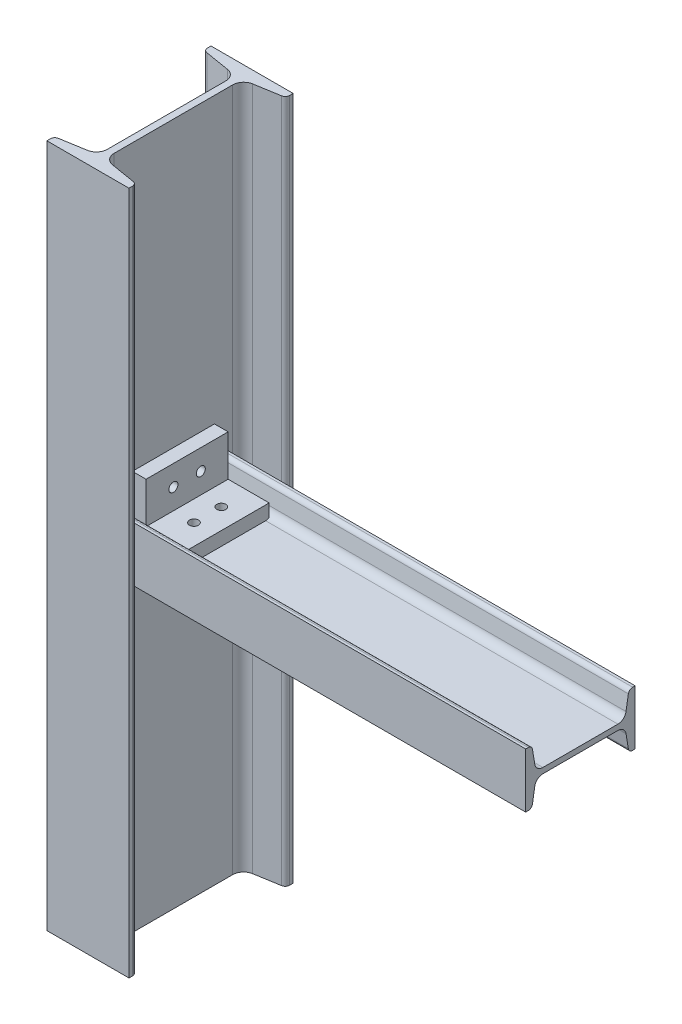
ISO-10303-21;
HEADER;
FILE_DESCRIPTION(('STEP AP214'),'2;1');
FILE_NAME('part.step','',(''),(''),'','','');
FILE_SCHEMA(('AUTOMOTIVE_DESIGN { 1 0 10303 214 1 1 1 1 }'));
ENDSEC;
DATA;
#1=APPLICATION_CONTEXT('core data for automotive mechanical design processes');
#2=APPLICATION_PROTOCOL_DEFINITION('international standard','automotive_design',2000,#1);
#3=PRODUCT_CONTEXT('',#1,'mechanical');
#4=PRODUCT('Part','Part','',(#3));
#5=PRODUCT_RELATED_PRODUCT_CATEGORY('part','',(#4));
#6=PRODUCT_DEFINITION_FORMATION('','',#4);
#7=PRODUCT_DEFINITION_CONTEXT('part definition',#1,'design');
#8=PRODUCT_DEFINITION('design','',#6,#7);
#9=PRODUCT_DEFINITION_SHAPE('','',#8);
#10=(LENGTH_UNIT() NAMED_UNIT(*) SI_UNIT(.MILLI.,.METRE.));
#11=(NAMED_UNIT(*) PLANE_ANGLE_UNIT() SI_UNIT($,.RADIAN.));
#12=(NAMED_UNIT(*) SI_UNIT($,.STERADIAN.) SOLID_ANGLE_UNIT());
#13=UNCERTAINTY_MEASURE_WITH_UNIT(LENGTH_MEASURE(1.E-05),#10,'distance_accuracy_value','');
#14=(GEOMETRIC_REPRESENTATION_CONTEXT(3) GLOBAL_UNCERTAINTY_ASSIGNED_CONTEXT((#13)) GLOBAL_UNIT_ASSIGNED_CONTEXT((#10,
#11,#12)) REPRESENTATION_CONTEXT('',''));
#15=CARTESIAN_POINT('',(0.,0.,0.));
#16=DIRECTION('',(0.,0.,1.));
#17=DIRECTION('',(1.,0.,0.));
#18=AXIS2_PLACEMENT_3D('',#15,#16,#17);
#19=CARTESIAN_POINT('',(12.5,12.,30.));
#20=DIRECTION('',(0.,-1.,0.));
#21=DIRECTION('',(0.,0.,-1.));
#22=AXIS2_PLACEMENT_3D('',#19,#20,#21);
#23=PLANE('',#22);
#24=CARTESIAN_POINT('',(27.5,12.,10.));
#25=DIRECTION('',(0.,1.,0.));
#26=DIRECTION('',(0.,0.,1.));
#27=AXIS2_PLACEMENT_3D('',#24,#25,#26);
#28=CIRCLE('',#27,3.3);
#29=CARTESIAN_POINT('',(27.5,12.,13.3));
#30=VERTEX_POINT('',#29);
#31=EDGE_CURVE('E291',#30,#30,#28,.T.);
#32=ORIENTED_EDGE('',*,*,#31,.F.);
#33=EDGE_LOOP('',(#32));
#34=FACE_BOUND('',#33,.T.);
#35=DIRECTION('',(-1.,0.,0.));
#36=VECTOR('',#35,1.);
#37=CARTESIAN_POINT('',(12.5,12.,-30.));
#38=LINE('',#37,#36);
#39=CARTESIAN_POINT('',(42.5,12.,-30.));
#40=VERTEX_POINT('',#39);
#41=CARTESIAN_POINT('',(12.5,12.,-30.));
#42=VERTEX_POINT('',#41);
#43=EDGE_CURVE('E231',#40,#42,#38,.T.);
#44=ORIENTED_EDGE('',*,*,#43,.T.);
#45=DIRECTION('',(0.,0.,-1.));
#46=VECTOR('',#45,1.);
#47=CARTESIAN_POINT('',(12.5,12.,30.));
#48=LINE('',#47,#46);
#49=CARTESIAN_POINT('',(12.5,12.,30.));
#50=VERTEX_POINT('',#49);
#51=EDGE_CURVE('E218',#50,#42,#48,.T.);
#52=ORIENTED_EDGE('',*,*,#51,.F.);
#53=DIRECTION('',(-1.,0.,0.));
#54=VECTOR('',#53,1.);
#55=CARTESIAN_POINT('',(12.5,12.,30.));
#56=LINE('',#55,#54);
#57=CARTESIAN_POINT('',(42.5,12.,30.));
#58=VERTEX_POINT('',#57);
#59=EDGE_CURVE('E209',#58,#50,#56,.T.);
#60=ORIENTED_EDGE('',*,*,#59,.F.);
#61=DIRECTION('',(0.,0.,-1.));
#62=VECTOR('',#61,1.);
#63=CARTESIAN_POINT('',(42.5,12.,30.));
#64=LINE('',#63,#62);
#65=EDGE_CURVE('E152',#58,#40,#64,.T.);
#66=ORIENTED_EDGE('',*,*,#65,.T.);
#67=EDGE_LOOP('',(#44,#52,#60,#66));
#68=FACE_BOUND('',#67,.T.);
#69=CARTESIAN_POINT('',(27.5,12.,-10.));
#70=DIRECTION('',(0.,1.,0.));
#71=DIRECTION('',(0.,0.,1.));
#72=AXIS2_PLACEMENT_3D('',#69,#70,#71);
#73=CIRCLE('',#72,3.3);
#74=CARTESIAN_POINT('',(27.5,12.,-6.7));
#75=VERTEX_POINT('',#74);
#76=EDGE_CURVE('E303',#75,#75,#73,.T.);
#77=ORIENTED_EDGE('',*,*,#76,.F.);
#78=EDGE_LOOP('',(#77));
#79=FACE_BOUND('',#78,.T.);
#80=ADVANCED_FACE('F145',(#34,#68,#79),#23,.F.);
#81=CARTESIAN_POINT('',(2.5,2.,30.));
#82=DIRECTION('',(0.,1.,0.));
#83=DIRECTION('',(0.,0.,1.));
#84=AXIS2_PLACEMENT_3D('',#81,#82,#83);
#85=PLANE('',#84);
#86=CARTESIAN_POINT('',(27.5,2.,10.));
#87=DIRECTION('',(0.,1.,0.));
#88=DIRECTION('',(0.,0.,1.));
#89=AXIS2_PLACEMENT_3D('',#86,#87,#88);
#90=CIRCLE('',#89,3.3);
#91=CARTESIAN_POINT('',(27.5,2.,13.3));
#92=VERTEX_POINT('',#91);
#93=EDGE_CURVE('E297',#92,#92,#90,.T.);
#94=ORIENTED_EDGE('',*,*,#93,.T.);
#95=EDGE_LOOP('',(#94));
#96=FACE_BOUND('',#95,.T.);
#97=CARTESIAN_POINT('',(27.5,2.,-10.));
#98=DIRECTION('',(0.,1.,0.));
#99=DIRECTION('',(0.,0.,1.));
#100=AXIS2_PLACEMENT_3D('',#97,#98,#99);
#101=CIRCLE('',#100,3.3);
#102=CARTESIAN_POINT('',(27.5,2.,-6.7));
#103=VERTEX_POINT('',#102);
#104=EDGE_CURVE('E233',#103,#103,#101,.T.);
#105=ORIENTED_EDGE('',*,*,#104,.T.);
#106=EDGE_LOOP('',(#105));
#107=FACE_BOUND('',#106,.T.);
#108=DIRECTION('',(1.,0.,0.));
#109=VECTOR('',#108,1.);
#110=CARTESIAN_POINT('',(2.5,2.,-30.));
#111=LINE('',#110,#109);
#112=CARTESIAN_POINT('',(2.5,2.,-30.));
#113=VERTEX_POINT('',#112);
#114=CARTESIAN_POINT('',(42.5,2.,-30.));
#115=VERTEX_POINT('',#114);
#116=EDGE_CURVE('E227',#113,#115,#111,.T.);
#117=ORIENTED_EDGE('',*,*,#116,.T.);
#118=DIRECTION('',(0.,0.,-1.));
#119=VECTOR('',#118,1.);
#120=CARTESIAN_POINT('',(42.5,2.,30.));
#121=LINE('',#120,#119);
#122=CARTESIAN_POINT('',(42.5,2.,30.));
#123=VERTEX_POINT('',#122);
#124=EDGE_CURVE('E13',#123,#115,#121,.T.);
#125=ORIENTED_EDGE('',*,*,#124,.F.);
#126=DIRECTION('',(1.,0.,0.));
#127=VECTOR('',#126,1.);
#128=CARTESIAN_POINT('',(2.5,2.,30.));
#129=LINE('',#128,#127);
#130=CARTESIAN_POINT('',(2.5,2.,30.));
#131=VERTEX_POINT('',#130);
#132=EDGE_CURVE('E238',#131,#123,#129,.T.);
#133=ORIENTED_EDGE('',*,*,#132,.F.);
#134=DIRECTION('',(0.,0.,-1.));
#135=VECTOR('',#134,1.);
#136=CARTESIAN_POINT('',(2.5,2.,30.));
#137=LINE('',#136,#135);
#138=EDGE_CURVE('E225',#131,#113,#137,.T.);
#139=ORIENTED_EDGE('',*,*,#138,.T.);
#140=EDGE_LOOP('',(#117,#125,#133,#139));
#141=FACE_BOUND('',#140,.T.);
#142=ADVANCED_FACE('F144',(#96,#107,#141),#85,.F.);
#143=CARTESIAN_POINT('',(42.5,2.,30.));
#144=DIRECTION('',(-1.,0.,0.));
#145=DIRECTION('',(0.,0.,1.));
#146=AXIS2_PLACEMENT_3D('',#143,#144,#145);
#147=PLANE('',#146);
#148=DIRECTION('',(0.,1.,0.));
#149=VECTOR('',#148,1.);
#150=CARTESIAN_POINT('',(42.5,2.,-30.));
#151=LINE('',#150,#149);
#152=EDGE_CURVE('E229',#115,#40,#151,.T.);
#153=ORIENTED_EDGE('',*,*,#152,.T.);
#154=ORIENTED_EDGE('',*,*,#65,.F.);
#155=DIRECTION('',(0.,1.,0.));
#156=VECTOR('',#155,1.);
#157=CARTESIAN_POINT('',(42.5,2.,30.));
#158=LINE('',#157,#156);
#159=EDGE_CURVE('E197',#123,#58,#158,.T.);
#160=ORIENTED_EDGE('',*,*,#159,.F.);
#161=ORIENTED_EDGE('',*,*,#124,.T.);
#162=EDGE_LOOP('',(#153,#154,#160,#161));
#163=FACE_BOUND('',#162,.T.);
#164=ADVANCED_FACE('F269',(#163),#147,.F.);
#165=CARTESIAN_POINT('',(12.5,12.,30.));
#166=DIRECTION('',(-1.,0.,0.));
#167=DIRECTION('',(0.,0.,1.));
#168=AXIS2_PLACEMENT_3D('',#165,#166,#167);
#169=PLANE('',#168);
#170=CARTESIAN_POINT('',(12.5,27.,10.));
#171=DIRECTION('',(1.,0.,0.));
#172=DIRECTION('',(0.,0.,-1.));
#173=AXIS2_PLACEMENT_3D('',#170,#171,#172);
#174=CIRCLE('',#173,3.3);
#175=CARTESIAN_POINT('',(12.5,27.,6.7));
#176=VERTEX_POINT('',#175);
#177=EDGE_CURVE('E284',#176,#176,#174,.T.);
#178=ORIENTED_EDGE('',*,*,#177,.F.);
#179=EDGE_LOOP('',(#178));
#180=FACE_BOUND('',#179,.T.);
#181=CARTESIAN_POINT('',(12.5,27.,-10.));
#182=DIRECTION('',(1.,0.,0.));
#183=DIRECTION('',(0.,0.,-1.));
#184=AXIS2_PLACEMENT_3D('',#181,#182,#183);
#185=CIRCLE('',#184,3.3);
#186=CARTESIAN_POINT('',(12.5,27.,-13.3));
#187=VERTEX_POINT('',#186);
#188=EDGE_CURVE('E289',#187,#187,#185,.T.);
#189=ORIENTED_EDGE('',*,*,#188,.F.);
#190=EDGE_LOOP('',(#189));
#191=FACE_BOUND('',#190,.T.);
#192=DIRECTION('',(0.,1.,0.));
#193=VECTOR('',#192,1.);
#194=CARTESIAN_POINT('',(12.5,12.,-30.));
#195=LINE('',#194,#193);
#196=CARTESIAN_POINT('',(12.5,42.,-30.));
#197=VERTEX_POINT('',#196);
#198=EDGE_CURVE('E220',#42,#197,#195,.T.);
#199=ORIENTED_EDGE('',*,*,#198,.T.);
#200=DIRECTION('',(0.,0.,-1.));
#201=VECTOR('',#200,1.);
#202=CARTESIAN_POINT('',(12.5,42.,30.));
#203=LINE('',#202,#201);
#204=CARTESIAN_POINT('',(12.5,42.,30.));
#205=VERTEX_POINT('',#204);
#206=EDGE_CURVE('E213',#205,#197,#203,.T.);
#207=ORIENTED_EDGE('',*,*,#206,.F.);
#208=DIRECTION('',(0.,1.,0.));
#209=VECTOR('',#208,1.);
#210=CARTESIAN_POINT('',(12.5,12.,30.));
#211=LINE('',#210,#209);
#212=EDGE_CURVE('E201',#50,#205,#211,.T.);
#213=ORIENTED_EDGE('',*,*,#212,.F.);
#214=ORIENTED_EDGE('',*,*,#51,.T.);
#215=EDGE_LOOP('',(#199,#207,#213,#214));
#216=FACE_BOUND('',#215,.T.);
#217=ADVANCED_FACE('F212',(#180,#191,#216),#169,.F.);
#218=CARTESIAN_POINT('',(2.5,42.,30.));
#219=DIRECTION('',(0.,-1.,0.));
#220=DIRECTION('',(0.,0.,-1.));
#221=AXIS2_PLACEMENT_3D('',#218,#219,#220);
#222=PLANE('',#221);
#223=DIRECTION('',(-1.,0.,0.));
#224=VECTOR('',#223,1.);
#225=CARTESIAN_POINT('',(2.5,42.,-30.));
#226=LINE('',#225,#224);
#227=CARTESIAN_POINT('',(2.5,42.,-30.));
#228=VERTEX_POINT('',#227);
#229=EDGE_CURVE('E185',#197,#228,#226,.T.);
#230=ORIENTED_EDGE('',*,*,#229,.T.);
#231=DIRECTION('',(0.,0.,-1.));
#232=VECTOR('',#231,1.);
#233=CARTESIAN_POINT('',(2.5,42.,30.));
#234=LINE('',#233,#232);
#235=CARTESIAN_POINT('',(2.5,42.,30.));
#236=VERTEX_POINT('',#235);
#237=EDGE_CURVE('E219',#236,#228,#234,.T.);
#238=ORIENTED_EDGE('',*,*,#237,.F.);
#239=DIRECTION('',(-1.,0.,0.));
#240=VECTOR('',#239,1.);
#241=CARTESIAN_POINT('',(2.5,42.,30.));
#242=LINE('',#241,#240);
#243=EDGE_CURVE('E210',#205,#236,#242,.T.);
#244=ORIENTED_EDGE('',*,*,#243,.F.);
#245=ORIENTED_EDGE('',*,*,#206,.T.);
#246=EDGE_LOOP('',(#230,#238,#244,#245));
#247=FACE_BOUND('',#246,.T.);
#248=ADVANCED_FACE('F222',(#247),#222,.F.);
#249=CARTESIAN_POINT('',(2.5,2.,30.));
#250=DIRECTION('',(1.,0.,0.));
#251=DIRECTION('',(0.,0.,-1.));
#252=AXIS2_PLACEMENT_3D('',#249,#250,#251);
#253=PLANE('',#252);
#254=CARTESIAN_POINT('',(2.5,27.,10.));
#255=DIRECTION('',(1.,0.,0.));
#256=DIRECTION('',(0.,0.,-1.));
#257=AXIS2_PLACEMENT_3D('',#254,#255,#256);
#258=CIRCLE('',#257,3.3);
#259=CARTESIAN_POINT('',(2.5,27.,6.7));
#260=VERTEX_POINT('',#259);
#261=EDGE_CURVE('E288',#260,#260,#258,.T.);
#262=ORIENTED_EDGE('',*,*,#261,.T.);
#263=EDGE_LOOP('',(#262));
#264=FACE_BOUND('',#263,.T.);
#265=CARTESIAN_POINT('',(2.5,27.,-10.));
#266=DIRECTION('',(1.,0.,0.));
#267=DIRECTION('',(0.,0.,-1.));
#268=AXIS2_PLACEMENT_3D('',#265,#266,#267);
#269=CIRCLE('',#268,3.3);
#270=CARTESIAN_POINT('',(2.5,27.,-13.3));
#271=VERTEX_POINT('',#270);
#272=EDGE_CURVE('E286',#271,#271,#269,.T.);
#273=ORIENTED_EDGE('',*,*,#272,.T.);
#274=EDGE_LOOP('',(#273));
#275=FACE_BOUND('',#274,.T.);
#276=DIRECTION('',(0.,-1.,0.));
#277=VECTOR('',#276,1.);
#278=CARTESIAN_POINT('',(2.5,2.,-30.));
#279=LINE('',#278,#277);
#280=EDGE_CURVE('E189',#228,#113,#279,.T.);
#281=ORIENTED_EDGE('',*,*,#280,.T.);
#282=ORIENTED_EDGE('',*,*,#138,.F.);
#283=DIRECTION('',(0.,-1.,0.));
#284=VECTOR('',#283,1.);
#285=CARTESIAN_POINT('',(2.5,2.,30.));
#286=LINE('',#285,#284);
#287=EDGE_CURVE('E156',#236,#131,#286,.T.);
#288=ORIENTED_EDGE('',*,*,#287,.F.);
#289=ORIENTED_EDGE('',*,*,#237,.T.);
#290=EDGE_LOOP('',(#281,#282,#288,#289));
#291=FACE_BOUND('',#290,.T.);
#292=ADVANCED_FACE('F252',(#264,#275,#291),#253,.F.);
#293=CARTESIAN_POINT('',(2.5,2.,30.));
#294=DIRECTION('',(0.,0.,1.));
#295=DIRECTION('',(1.,0.,0.));
#296=AXIS2_PLACEMENT_3D('',#293,#294,#295);
#297=PLANE('',#296);
#298=ORIENTED_EDGE('',*,*,#132,.T.);
#299=ORIENTED_EDGE('',*,*,#159,.T.);
#300=ORIENTED_EDGE('',*,*,#59,.T.);
#301=ORIENTED_EDGE('',*,*,#212,.T.);
#302=ORIENTED_EDGE('',*,*,#243,.T.);
#303=ORIENTED_EDGE('',*,*,#287,.T.);
#304=EDGE_LOOP('',(#298,#299,#300,#301,#302,#303));
#305=FACE_BOUND('',#304,.T.);
#306=ADVANCED_FACE('F204',(#305),#297,.T.);
#307=CARTESIAN_POINT('',(2.5,2.,-30.));
#308=DIRECTION('',(0.,0.,1.));
#309=DIRECTION('',(1.,0.,0.));
#310=AXIS2_PLACEMENT_3D('',#307,#308,#309);
#311=PLANE('',#310);
#312=ORIENTED_EDGE('',*,*,#116,.F.);
#313=ORIENTED_EDGE('',*,*,#280,.F.);
#314=ORIENTED_EDGE('',*,*,#229,.F.);
#315=ORIENTED_EDGE('',*,*,#198,.F.);
#316=ORIENTED_EDGE('',*,*,#43,.F.);
#317=ORIENTED_EDGE('',*,*,#152,.F.);
#318=EDGE_LOOP('',(#312,#313,#314,#315,#316,#317));
#319=FACE_BOUND('',#318,.T.);
#320=ADVANCED_FACE('F250',(#319),#311,.F.);
#321=CARTESIAN_POINT('',(27.5,12.,-10.));
#322=DIRECTION('',(0.,1.,0.));
#323=DIRECTION('',(0.,0.,1.));
#324=AXIS2_PLACEMENT_3D('',#321,#322,#323);
#325=CYLINDRICAL_SURFACE('',#324,3.3);
#326=ORIENTED_EDGE('',*,*,#104,.F.);
#327=EDGE_LOOP('',(#326));
#328=FACE_BOUND('',#327,.T.);
#329=ORIENTED_EDGE('',*,*,#76,.T.);
#330=EDGE_LOOP('',(#329));
#331=FACE_BOUND('',#330,.T.);
#332=ADVANCED_FACE('F315',(#328,#331),#325,.F.);
#333=CARTESIAN_POINT('',(27.5,12.,10.));
#334=DIRECTION('',(0.,1.,0.));
#335=DIRECTION('',(0.,0.,1.));
#336=AXIS2_PLACEMENT_3D('',#333,#334,#335);
#337=CYLINDRICAL_SURFACE('',#336,3.3);
#338=ORIENTED_EDGE('',*,*,#93,.F.);
#339=EDGE_LOOP('',(#338));
#340=FACE_BOUND('',#339,.T.);
#341=ORIENTED_EDGE('',*,*,#31,.T.);
#342=EDGE_LOOP('',(#341));
#343=FACE_BOUND('',#342,.T.);
#344=ADVANCED_FACE('F314',(#340,#343),#337,.F.);
#345=CARTESIAN_POINT('',(12.5,27.,-10.));
#346=DIRECTION('',(1.,0.,0.));
#347=DIRECTION('',(0.,0.,-1.));
#348=AXIS2_PLACEMENT_3D('',#345,#346,#347);
#349=CYLINDRICAL_SURFACE('',#348,3.3);
#350=ORIENTED_EDGE('',*,*,#272,.F.);
#351=EDGE_LOOP('',(#350));
#352=FACE_BOUND('',#351,.T.);
#353=ORIENTED_EDGE('',*,*,#188,.T.);
#354=EDGE_LOOP('',(#353));
#355=FACE_BOUND('',#354,.T.);
#356=ADVANCED_FACE('F321',(#352,#355),#349,.F.);
#357=CARTESIAN_POINT('',(12.5,27.,10.));
#358=DIRECTION('',(1.,0.,0.));
#359=DIRECTION('',(0.,0.,-1.));
#360=AXIS2_PLACEMENT_3D('',#357,#358,#359);
#361=CYLINDRICAL_SURFACE('',#360,3.3);
#362=ORIENTED_EDGE('',*,*,#261,.F.);
#363=EDGE_LOOP('',(#362));
#364=FACE_BOUND('',#363,.T.);
#365=ORIENTED_EDGE('',*,*,#177,.T.);
#366=EDGE_LOOP('',(#365));
#367=FACE_BOUND('',#366,.T.);
#368=ADVANCED_FACE('F328',(#364,#367),#361,.F.);
#369=CLOSED_SHELL('',(#80,#142,#164,#217,#248,#292,#306,#320,#332,#344,#356,#368));
#370=MANIFOLD_SOLID_BREP('B2',#369);
#371=CARTESIAN_POINT('',(300.,-16.825,-38.189516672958));
#372=DIRECTION('',(-1.,0.,0.));
#373=DIRECTION('',(0.,0.,1.));
#374=AXIS2_PLACEMENT_3D('',#371,#372,#373);
#375=PLANE('',#374);
#376=DIRECTION('',(0.,1.,0.));
#377=VECTOR('',#376,1.);
#378=CARTESIAN_POINT('',(300.,20.,-40.));
#379=LINE('',#378,#377);
#380=CARTESIAN_POINT('',(300.,-20.,-40.));
#381=VERTEX_POINT('',#380);
#382=CARTESIAN_POINT('',(300.,20.,-40.));
#383=VERTEX_POINT('',#382);
#384=EDGE_CURVE('E542',#381,#383,#379,.T.);
#385=ORIENTED_EDGE('',*,*,#384,.T.);
#386=DIRECTION('',(0.,0.,1.));
#387=VECTOR('',#386,1.);
#388=CARTESIAN_POINT('',(300.,20.,-38.189516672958));
#389=LINE('',#388,#387);
#390=CARTESIAN_POINT('',(300.,20.,-38.189516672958));
#391=VERTEX_POINT('',#390);
#392=EDGE_CURVE('E556',#383,#391,#389,.T.);
#393=ORIENTED_EDGE('',*,*,#392,.T.);
#394=CARTESIAN_POINT('',(300.,16.825,-38.189516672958));
#395=DIRECTION('',(1.,0.,0.));
#396=DIRECTION('',(0.,0.,-1.));
#397=AXIS2_PLACEMENT_3D('',#394,#395,#396);
#398=CIRCLE('',#397,3.175);
#399=CARTESIAN_POINT('',(300.,17.3470038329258,-35.0577221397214));
#400=VERTEX_POINT('',#399);
#401=EDGE_CURVE('E566',#391,#400,#398,.T.);
#402=ORIENTED_EDGE('',*,*,#401,.T.);
#403=DIRECTION('',(0.,-0.986391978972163,0.164410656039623));
#404=VECTOR('',#403,1.);
#405=CARTESIAN_POINT('',(300.,7.01353606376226,-33.335351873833));
#406=LINE('',#405,#404);
#407=CARTESIAN_POINT('',(300.,7.01353606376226,-33.335351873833));
#408=VERTEX_POINT('',#407);
#409=EDGE_CURVE('E571',#400,#408,#406,.T.);
#410=ORIENTED_EDGE('',*,*,#409,.T.);
#411=CARTESIAN_POINT('',(300.,8.,-27.417));
#412=DIRECTION('',(-1.,0.,0.));
#413=DIRECTION('',(0.,0.,-1.));
#414=AXIS2_PLACEMENT_3D('',#411,#412,#413);
#415=CIRCLE('',#414,6.);
#416=CARTESIAN_POINT('',(300.,2.,-27.417));
#417=VERTEX_POINT('',#416);
#418=EDGE_CURVE('E577',#408,#417,#415,.T.);
#419=ORIENTED_EDGE('',*,*,#418,.T.);
#420=DIRECTION('',(0.,0.,1.));
#421=VECTOR('',#420,1.);
#422=CARTESIAN_POINT('',(300.,2.,27.417));
#423=LINE('',#422,#421);
#424=CARTESIAN_POINT('',(300.,2.,27.417));
#425=VERTEX_POINT('',#424);
#426=EDGE_CURVE('E584',#417,#425,#423,.T.);
#427=ORIENTED_EDGE('',*,*,#426,.T.);
#428=CARTESIAN_POINT('',(300.,8.00000000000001,27.417));
#429=DIRECTION('',(-1.,0.,0.));
#430=DIRECTION('',(0.,0.,-1.));
#431=AXIS2_PLACEMENT_3D('',#428,#429,#430);
#432=CIRCLE('',#431,6.00000000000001);
#433=CARTESIAN_POINT('',(300.,7.01353606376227,33.335351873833));
#434=VERTEX_POINT('',#433);
#435=EDGE_CURVE('E587',#425,#434,#432,.T.);
#436=ORIENTED_EDGE('',*,*,#435,.T.);
#437=DIRECTION('',(0.,0.986391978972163,0.164410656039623));
#438=VECTOR('',#437,1.);
#439=CARTESIAN_POINT('',(300.,17.3470038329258,35.0577221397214));
#440=LINE('',#439,#438);
#441=CARTESIAN_POINT('',(300.,17.3470038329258,35.0577221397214));
#442=VERTEX_POINT('',#441);
#443=EDGE_CURVE('E593',#434,#442,#440,.T.);
#444=ORIENTED_EDGE('',*,*,#443,.T.);
#445=CARTESIAN_POINT('',(300.,16.825,38.189516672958));
#446=DIRECTION('',(1.,0.,0.));
#447=DIRECTION('',(0.,0.,-1.));
#448=AXIS2_PLACEMENT_3D('',#445,#446,#447);
#449=CIRCLE('',#448,3.175);
#450=CARTESIAN_POINT('',(300.,20.,38.189516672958));
#451=VERTEX_POINT('',#450);
#452=EDGE_CURVE('E597',#442,#451,#449,.T.);
#453=ORIENTED_EDGE('',*,*,#452,.T.);
#454=DIRECTION('',(0.,0.,1.));
#455=VECTOR('',#454,1.);
#456=CARTESIAN_POINT('',(300.,20.,40.));
#457=LINE('',#456,#455);
#458=CARTESIAN_POINT('',(300.,20.,40.));
#459=VERTEX_POINT('',#458);
#460=EDGE_CURVE('E604',#451,#459,#457,.T.);
#461=ORIENTED_EDGE('',*,*,#460,.T.);
#462=DIRECTION('',(0.,-1.,0.));
#463=VECTOR('',#462,1.);
#464=CARTESIAN_POINT('',(300.,-20.,40.));
#465=LINE('',#464,#463);
#466=CARTESIAN_POINT('',(300.,-20.,40.));
#467=VERTEX_POINT('',#466);
#468=EDGE_CURVE('E607',#459,#467,#465,.T.);
#469=ORIENTED_EDGE('',*,*,#468,.T.);
#470=DIRECTION('',(0.,0.,-1.));
#471=VECTOR('',#470,1.);
#472=CARTESIAN_POINT('',(300.,-20.,38.189516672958));
#473=LINE('',#472,#471);
#474=CARTESIAN_POINT('',(300.,-20.,38.189516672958));
#475=VERTEX_POINT('',#474);
#476=EDGE_CURVE('E612',#467,#475,#473,.T.);
#477=ORIENTED_EDGE('',*,*,#476,.T.);
#478=CARTESIAN_POINT('',(300.,-16.825,38.189516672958));
#479=DIRECTION('',(1.,0.,0.));
#480=DIRECTION('',(0.,0.,1.));
#481=AXIS2_PLACEMENT_3D('',#478,#479,#480);
#482=CIRCLE('',#481,3.175);
#483=CARTESIAN_POINT('',(300.,-17.3470038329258,35.0577221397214));
#484=VERTEX_POINT('',#483);
#485=EDGE_CURVE('E618',#475,#484,#482,.T.);
#486=ORIENTED_EDGE('',*,*,#485,.T.);
#487=DIRECTION('',(0.,0.986391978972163,-0.164410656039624));
#488=VECTOR('',#487,1.);
#489=CARTESIAN_POINT('',(300.,-7.01353606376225,33.335351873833));
#490=LINE('',#489,#488);
#491=CARTESIAN_POINT('',(300.,-7.01353606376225,33.335351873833));
#492=VERTEX_POINT('',#491);
#493=EDGE_CURVE('E623',#484,#492,#490,.T.);
#494=ORIENTED_EDGE('',*,*,#493,.T.);
#495=CARTESIAN_POINT('',(300.,-7.99999999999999,27.417));
#496=DIRECTION('',(-1.,0.,0.));
#497=DIRECTION('',(0.,0.,-1.));
#498=AXIS2_PLACEMENT_3D('',#495,#496,#497);
#499=CIRCLE('',#498,5.99999999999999);
#500=CARTESIAN_POINT('',(300.,-2.,27.417));
#501=VERTEX_POINT('',#500);
#502=EDGE_CURVE('E626',#492,#501,#499,.T.);
#503=ORIENTED_EDGE('',*,*,#502,.T.);
#504=DIRECTION('',(0.,0.,-1.));
#505=VECTOR('',#504,1.);
#506=CARTESIAN_POINT('',(300.,-2.,-27.417));
#507=LINE('',#506,#505);
#508=CARTESIAN_POINT('',(300.,-2.,-27.417));
#509=VERTEX_POINT('',#508);
#510=EDGE_CURVE('E631',#501,#509,#507,.T.);
#511=ORIENTED_EDGE('',*,*,#510,.T.);
#512=CARTESIAN_POINT('',(300.,-8.,-27.417));
#513=DIRECTION('',(-1.,0.,0.));
#514=DIRECTION('',(0.,0.,-1.));
#515=AXIS2_PLACEMENT_3D('',#512,#513,#514);
#516=CIRCLE('',#515,6.);
#517=CARTESIAN_POINT('',(300.,-7.01353606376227,-33.335351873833));
#518=VERTEX_POINT('',#517);
#519=EDGE_CURVE('E636',#509,#518,#516,.T.);
#520=ORIENTED_EDGE('',*,*,#519,.T.);
#521=DIRECTION('',(0.,-0.986391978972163,-0.164410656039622));
#522=VECTOR('',#521,1.);
#523=CARTESIAN_POINT('',(300.,-17.3470038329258,-35.0577221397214));
#524=LINE('',#523,#522);
#525=CARTESIAN_POINT('',(300.,-17.3470038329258,-35.0577221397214));
#526=VERTEX_POINT('',#525);
#527=EDGE_CURVE('E642',#518,#526,#524,.T.);
#528=ORIENTED_EDGE('',*,*,#527,.T.);
#529=CARTESIAN_POINT('',(300.,-16.825,-38.189516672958));
#530=DIRECTION('',(1.,0.,0.));
#531=DIRECTION('',(0.,0.,1.));
#532=AXIS2_PLACEMENT_3D('',#529,#530,#531);
#533=CIRCLE('',#532,3.17500000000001);
#534=CARTESIAN_POINT('',(300.,-20.,-38.189516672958));
#535=VERTEX_POINT('',#534);
#536=EDGE_CURVE('E553',#526,#535,#533,.T.);
#537=ORIENTED_EDGE('',*,*,#536,.T.);
#538=DIRECTION('',(0.,0.,-1.));
#539=VECTOR('',#538,1.);
#540=CARTESIAN_POINT('',(300.,-20.,-40.));
#541=LINE('',#540,#539);
#542=EDGE_CURVE('E536',#535,#381,#541,.T.);
#543=ORIENTED_EDGE('',*,*,#542,.T.);
#544=EDGE_LOOP('',(#385,#393,#402,#410,#419,#427,#436,#444,#453,#461,#469,#477,#486,#494,#503,
#511,#520,#528,#537,#543));
#545=FACE_BOUND('',#544,.T.);
#546=ADVANCED_FACE('F397',(#545),#375,.F.);
#547=CARTESIAN_POINT('',(0.,20.,-40.));
#548=DIRECTION('',(0.,0.,-1.));
#549=DIRECTION('',(0.,1.,0.));
#550=AXIS2_PLACEMENT_3D('',#547,#548,#549);
#551=PLANE('',#550);
#552=DIRECTION('',(0.,-1.,0.));
#553=VECTOR('',#552,1.);
#554=CARTESIAN_POINT('',(2.5,20.,-40.));
#555=LINE('',#554,#553);
#556=CARTESIAN_POINT('',(2.5,20.,-40.));
#557=VERTEX_POINT('',#556);
#558=CARTESIAN_POINT('',(2.5,-20.,-40.));
#559=VERTEX_POINT('',#558);
#560=EDGE_CURVE('E409',#557,#559,#555,.T.);
#561=ORIENTED_EDGE('',*,*,#560,.F.);
#562=DIRECTION('',(1.,0.,0.));
#563=VECTOR('',#562,1.);
#564=CARTESIAN_POINT('',(0.,20.,-40.));
#565=LINE('',#564,#563);
#566=EDGE_CURVE('E558',#557,#383,#565,.T.);
#567=ORIENTED_EDGE('',*,*,#566,.T.);
#568=ORIENTED_EDGE('',*,*,#384,.F.);
#569=DIRECTION('',(1.,0.,0.));
#570=VECTOR('',#569,1.);
#571=CARTESIAN_POINT('',(0.,-20.,-40.));
#572=LINE('',#571,#570);
#573=EDGE_CURVE('E531',#559,#381,#572,.T.);
#574=ORIENTED_EDGE('',*,*,#573,.F.);
#575=EDGE_LOOP('',(#561,#567,#568,#574));
#576=FACE_BOUND('',#575,.T.);
#577=ADVANCED_FACE('F555',(#576),#551,.T.);
#578=CARTESIAN_POINT('',(0.,20.,-38.189516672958));
#579=DIRECTION('',(0.,1.,0.));
#580=DIRECTION('',(0.,0.,1.));
#581=AXIS2_PLACEMENT_3D('',#578,#579,#580);
#582=PLANE('',#581);
#583=DIRECTION('',(0.,0.,-1.));
#584=VECTOR('',#583,1.);
#585=CARTESIAN_POINT('',(2.5,20.,-38.189516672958));
#586=LINE('',#585,#584);
#587=CARTESIAN_POINT('',(2.5,20.,-38.189516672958));
#588=VERTEX_POINT('',#587);
#589=EDGE_CURVE('E684',#588,#557,#586,.T.);
#590=ORIENTED_EDGE('',*,*,#589,.F.);
#591=DIRECTION('',(1.,0.,0.));
#592=VECTOR('',#591,1.);
#593=CARTESIAN_POINT('',(0.,20.,-38.189516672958));
#594=LINE('',#593,#592);
#595=EDGE_CURVE('E562',#588,#391,#594,.T.);
#596=ORIENTED_EDGE('',*,*,#595,.T.);
#597=ORIENTED_EDGE('',*,*,#392,.F.);
#598=ORIENTED_EDGE('',*,*,#566,.F.);
#599=EDGE_LOOP('',(#590,#596,#597,#598));
#600=FACE_BOUND('',#599,.T.);
#601=ADVANCED_FACE('F686',(#600),#582,.T.);
#602=CARTESIAN_POINT('',(0.,16.825,-38.189516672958));
#603=DIRECTION('',(1.,0.,0.));
#604=DIRECTION('',(0.,0.,-1.));
#605=AXIS2_PLACEMENT_3D('',#602,#603,#604);
#606=CYLINDRICAL_SURFACE('',#605,3.175);
#607=CARTESIAN_POINT('',(2.5,16.825,-38.189516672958));
#608=DIRECTION('',(1.,0.,0.));
#609=DIRECTION('',(0.,0.,-1.));
#610=AXIS2_PLACEMENT_3D('',#607,#608,#609);
#611=CIRCLE('',#610,3.175);
#612=CARTESIAN_POINT('',(2.5,17.3470038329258,-35.0577221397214));
#613=VERTEX_POINT('',#612);
#614=EDGE_CURVE('E413',#613,#588,#611,.F.);
#615=ORIENTED_EDGE('',*,*,#614,.F.);
#616=DIRECTION('',(1.,0.,0.));
#617=VECTOR('',#616,1.);
#618=CARTESIAN_POINT('',(0.,17.3470038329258,-35.0577221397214));
#619=LINE('',#618,#617);
#620=EDGE_CURVE('E567',#613,#400,#619,.T.);
#621=ORIENTED_EDGE('',*,*,#620,.T.);
#622=ORIENTED_EDGE('',*,*,#401,.F.);
#623=ORIENTED_EDGE('',*,*,#595,.F.);
#624=EDGE_LOOP('',(#615,#621,#622,#623));
#625=FACE_BOUND('',#624,.T.);
#626=ADVANCED_FACE('F693',(#625),#606,.T.);
#627=CARTESIAN_POINT('',(0.,7.01353606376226,-33.335351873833));
#628=DIRECTION('',(0.,0.164410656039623,0.986391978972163));
#629=DIRECTION('',(0.,-0.986391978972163,0.164410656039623));
#630=AXIS2_PLACEMENT_3D('',#627,#628,#629);
#631=PLANE('',#630);
#632=DIRECTION('',(0.,0.986391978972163,-0.164410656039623));
#633=VECTOR('',#632,1.);
#634=CARTESIAN_POINT('',(2.5,7.01353606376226,-33.335351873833));
#635=LINE('',#634,#633);
#636=CARTESIAN_POINT('',(2.5,7.01353606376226,-33.335351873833));
#637=VERTEX_POINT('',#636);
#638=EDGE_CURVE('E420',#637,#613,#635,.T.);
#639=ORIENTED_EDGE('',*,*,#638,.F.);
#640=DIRECTION('',(1.,0.,0.));
#641=VECTOR('',#640,1.);
#642=CARTESIAN_POINT('',(0.,7.01353606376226,-33.335351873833));
#643=LINE('',#642,#641);
#644=EDGE_CURVE('E573',#637,#408,#643,.T.);
#645=ORIENTED_EDGE('',*,*,#644,.T.);
#646=ORIENTED_EDGE('',*,*,#409,.F.);
#647=ORIENTED_EDGE('',*,*,#620,.F.);
#648=EDGE_LOOP('',(#639,#645,#646,#647));
#649=FACE_BOUND('',#648,.T.);
#650=ADVANCED_FACE('F696',(#649),#631,.T.);
#651=CARTESIAN_POINT('',(0.,8.,-27.417));
#652=DIRECTION('',(1.,0.,0.));
#653=DIRECTION('',(0.,0.,-1.));
#654=AXIS2_PLACEMENT_3D('',#651,#652,#653);
#655=CYLINDRICAL_SURFACE('',#654,6.);
#656=CARTESIAN_POINT('',(2.5,8.,-27.417));
#657=DIRECTION('',(1.,0.,0.));
#658=DIRECTION('',(0.,0.,-1.));
#659=AXIS2_PLACEMENT_3D('',#656,#657,#658);
#660=CIRCLE('',#659,6.);
#661=CARTESIAN_POINT('',(2.5,2.,-27.417));
#662=VERTEX_POINT('',#661);
#663=EDGE_CURVE('E682',#662,#637,#660,.T.);
#664=ORIENTED_EDGE('',*,*,#663,.F.);
#665=DIRECTION('',(1.,0.,0.));
#666=VECTOR('',#665,1.);
#667=CARTESIAN_POINT('',(0.,2.,-27.417));
#668=LINE('',#667,#666);
#669=EDGE_CURVE('E576',#662,#417,#668,.T.);
#670=ORIENTED_EDGE('',*,*,#669,.T.);
#671=ORIENTED_EDGE('',*,*,#418,.F.);
#672=ORIENTED_EDGE('',*,*,#644,.F.);
#673=EDGE_LOOP('',(#664,#670,#671,#672));
#674=FACE_BOUND('',#673,.T.);
#675=ADVANCED_FACE('F705',(#674),#655,.F.);
#676=CARTESIAN_POINT('',(0.,2.,27.417));
#677=DIRECTION('',(0.,1.,0.));
#678=DIRECTION('',(0.,0.,1.));
#679=AXIS2_PLACEMENT_3D('',#676,#677,#678);
#680=PLANE('',#679);
#681=CARTESIAN_POINT('',(27.5,2.,-10.));
#682=DIRECTION('',(0.,1.,0.));
#683=DIRECTION('',(0.,0.,1.));
#684=AXIS2_PLACEMENT_3D('',#681,#682,#683);
#685=CIRCLE('',#684,3.3);
#686=CARTESIAN_POINT('',(27.5,2.,-6.7));
#687=VERTEX_POINT('',#686);
#688=EDGE_CURVE('E545',#687,#687,#685,.T.);
#689=ORIENTED_EDGE('',*,*,#688,.F.);
#690=EDGE_LOOP('',(#689));
#691=FACE_BOUND('',#690,.T.);
#692=CARTESIAN_POINT('',(27.5,2.,10.));
#693=DIRECTION('',(0.,1.,0.));
#694=DIRECTION('',(0.,0.,1.));
#695=AXIS2_PLACEMENT_3D('',#692,#693,#694);
#696=CIRCLE('',#695,3.3);
#697=CARTESIAN_POINT('',(27.5,2.,13.3));
#698=VERTEX_POINT('',#697);
#699=EDGE_CURVE('E833',#698,#698,#696,.T.);
#700=ORIENTED_EDGE('',*,*,#699,.F.);
#701=EDGE_LOOP('',(#700));
#702=FACE_BOUND('',#701,.T.);
#703=DIRECTION('',(0.,0.,-1.));
#704=VECTOR('',#703,1.);
#705=CARTESIAN_POINT('',(2.5,2.,27.417));
#706=LINE('',#705,#704);
#707=CARTESIAN_POINT('',(2.5,2.,27.417));
#708=VERTEX_POINT('',#707);
#709=EDGE_CURVE('E678',#708,#662,#706,.T.);
#710=ORIENTED_EDGE('',*,*,#709,.F.);
#711=DIRECTION('',(1.,0.,0.));
#712=VECTOR('',#711,1.);
#713=CARTESIAN_POINT('',(0.,2.,27.417));
#714=LINE('',#713,#712);
#715=EDGE_CURVE('E583',#708,#425,#714,.T.);
#716=ORIENTED_EDGE('',*,*,#715,.T.);
#717=ORIENTED_EDGE('',*,*,#426,.F.);
#718=ORIENTED_EDGE('',*,*,#669,.F.);
#719=EDGE_LOOP('',(#710,#716,#717,#718));
#720=FACE_BOUND('',#719,.T.);
#721=ADVANCED_FACE('F707',(#691,#702,#720),#680,.T.);
#722=CARTESIAN_POINT('',(0.,8.00000000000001,27.417));
#723=DIRECTION('',(1.,0.,0.));
#724=DIRECTION('',(0.,0.,-1.));
#725=AXIS2_PLACEMENT_3D('',#722,#723,#724);
#726=CYLINDRICAL_SURFACE('',#725,6.00000000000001);
#727=CARTESIAN_POINT('',(2.5,8.00000000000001,27.417));
#728=DIRECTION('',(1.,0.,0.));
#729=DIRECTION('',(0.,0.,-1.));
#730=AXIS2_PLACEMENT_3D('',#727,#728,#729);
#731=CIRCLE('',#730,6.00000000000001);
#732=CARTESIAN_POINT('',(2.5,7.01353606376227,33.335351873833));
#733=VERTEX_POINT('',#732);
#734=EDGE_CURVE('E680',#733,#708,#731,.T.);
#735=ORIENTED_EDGE('',*,*,#734,.F.);
#736=DIRECTION('',(1.,0.,0.));
#737=VECTOR('',#736,1.);
#738=CARTESIAN_POINT('',(0.,7.01353606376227,33.335351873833));
#739=LINE('',#738,#737);
#740=EDGE_CURVE('E589',#733,#434,#739,.T.);
#741=ORIENTED_EDGE('',*,*,#740,.T.);
#742=ORIENTED_EDGE('',*,*,#435,.F.);
#743=ORIENTED_EDGE('',*,*,#715,.F.);
#744=EDGE_LOOP('',(#735,#741,#742,#743));
#745=FACE_BOUND('',#744,.T.);
#746=ADVANCED_FACE('F711',(#745),#726,.F.);
#747=CARTESIAN_POINT('',(0.,17.3470038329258,35.0577221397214));
#748=DIRECTION('',(0.,0.164410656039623,-0.986391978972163));
#749=DIRECTION('',(0.,0.986391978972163,0.164410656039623));
#750=AXIS2_PLACEMENT_3D('',#747,#748,#749);
#751=PLANE('',#750);
#752=DIRECTION('',(0.,-0.986391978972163,-0.164410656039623));
#753=VECTOR('',#752,1.);
#754=CARTESIAN_POINT('',(2.5,17.3470038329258,35.0577221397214));
#755=LINE('',#754,#753);
#756=CARTESIAN_POINT('',(2.5,17.3470038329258,35.0577221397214));
#757=VERTEX_POINT('',#756);
#758=EDGE_CURVE('E677',#757,#733,#755,.T.);
#759=ORIENTED_EDGE('',*,*,#758,.F.);
#760=DIRECTION('',(1.,0.,0.));
#761=VECTOR('',#760,1.);
#762=CARTESIAN_POINT('',(0.,17.3470038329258,35.0577221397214));
#763=LINE('',#762,#761);
#764=EDGE_CURVE('E592',#757,#442,#763,.T.);
#765=ORIENTED_EDGE('',*,*,#764,.T.);
#766=ORIENTED_EDGE('',*,*,#443,.F.);
#767=ORIENTED_EDGE('',*,*,#740,.F.);
#768=EDGE_LOOP('',(#759,#765,#766,#767));
#769=FACE_BOUND('',#768,.T.);
#770=ADVANCED_FACE('F717',(#769),#751,.T.);
#771=CARTESIAN_POINT('',(0.,16.825,38.189516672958));
#772=DIRECTION('',(1.,0.,0.));
#773=DIRECTION('',(0.,0.,-1.));
#774=AXIS2_PLACEMENT_3D('',#771,#772,#773);
#775=CYLINDRICAL_SURFACE('',#774,3.175);
#776=CARTESIAN_POINT('',(2.5,16.825,38.189516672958));
#777=DIRECTION('',(1.,0.,0.));
#778=DIRECTION('',(0.,0.,-1.));
#779=AXIS2_PLACEMENT_3D('',#776,#777,#778);
#780=CIRCLE('',#779,3.175);
#781=CARTESIAN_POINT('',(2.5,20.,38.189516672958));
#782=VERTEX_POINT('',#781);
#783=EDGE_CURVE('E674',#782,#757,#780,.F.);
#784=ORIENTED_EDGE('',*,*,#783,.F.);
#785=DIRECTION('',(1.,0.,0.));
#786=VECTOR('',#785,1.);
#787=CARTESIAN_POINT('',(0.,20.,38.189516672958));
#788=LINE('',#787,#786);
#789=EDGE_CURVE('E599',#782,#451,#788,.T.);
#790=ORIENTED_EDGE('',*,*,#789,.T.);
#791=ORIENTED_EDGE('',*,*,#452,.F.);
#792=ORIENTED_EDGE('',*,*,#764,.F.);
#793=EDGE_LOOP('',(#784,#790,#791,#792));
#794=FACE_BOUND('',#793,.T.);
#795=ADVANCED_FACE('F725',(#794),#775,.T.);
#796=CARTESIAN_POINT('',(0.,20.,40.));
#797=DIRECTION('',(0.,1.,0.));
#798=DIRECTION('',(0.,0.,1.));
#799=AXIS2_PLACEMENT_3D('',#796,#797,#798);
#800=PLANE('',#799);
#801=DIRECTION('',(0.,0.,-1.));
#802=VECTOR('',#801,1.);
#803=CARTESIAN_POINT('',(2.5,20.,40.));
#804=LINE('',#803,#802);
#805=CARTESIAN_POINT('',(2.5,20.,40.));
#806=VERTEX_POINT('',#805);
#807=EDGE_CURVE('E675',#806,#782,#804,.T.);
#808=ORIENTED_EDGE('',*,*,#807,.F.);
#809=DIRECTION('',(1.,0.,0.));
#810=VECTOR('',#809,1.);
#811=CARTESIAN_POINT('',(0.,20.,40.));
#812=LINE('',#811,#810);
#813=EDGE_CURVE('E603',#806,#459,#812,.T.);
#814=ORIENTED_EDGE('',*,*,#813,.T.);
#815=ORIENTED_EDGE('',*,*,#460,.F.);
#816=ORIENTED_EDGE('',*,*,#789,.F.);
#817=EDGE_LOOP('',(#808,#814,#815,#816));
#818=FACE_BOUND('',#817,.T.);
#819=ADVANCED_FACE('F727',(#818),#800,.T.);
#820=CARTESIAN_POINT('',(0.,-20.,40.));
#821=DIRECTION('',(0.,0.,1.));
#822=DIRECTION('',(0.,-1.,0.));
#823=AXIS2_PLACEMENT_3D('',#820,#821,#822);
#824=PLANE('',#823);
#825=DIRECTION('',(0.,1.,0.));
#826=VECTOR('',#825,1.);
#827=CARTESIAN_POINT('',(2.5,-20.,40.));
#828=LINE('',#827,#826);
#829=CARTESIAN_POINT('',(2.5,-20.,40.));
#830=VERTEX_POINT('',#829);
#831=EDGE_CURVE('E667',#830,#806,#828,.T.);
#832=ORIENTED_EDGE('',*,*,#831,.F.);
#833=DIRECTION('',(1.,0.,0.));
#834=VECTOR('',#833,1.);
#835=CARTESIAN_POINT('',(0.,-20.,40.));
#836=LINE('',#835,#834);
#837=EDGE_CURVE('E609',#830,#467,#836,.T.);
#838=ORIENTED_EDGE('',*,*,#837,.T.);
#839=ORIENTED_EDGE('',*,*,#468,.F.);
#840=ORIENTED_EDGE('',*,*,#813,.F.);
#841=EDGE_LOOP('',(#832,#838,#839,#840));
#842=FACE_BOUND('',#841,.T.);
#843=ADVANCED_FACE('F731',(#842),#824,.T.);
#844=CARTESIAN_POINT('',(0.,-20.,38.189516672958));
#845=DIRECTION('',(0.,-1.,0.));
#846=DIRECTION('',(0.,0.,-1.));
#847=AXIS2_PLACEMENT_3D('',#844,#845,#846);
#848=PLANE('',#847);
#849=DIRECTION('',(0.,0.,1.));
#850=VECTOR('',#849,1.);
#851=CARTESIAN_POINT('',(2.5,-20.,38.189516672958));
#852=LINE('',#851,#850);
#853=CARTESIAN_POINT('',(2.5,-20.,38.189516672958));
#854=VERTEX_POINT('',#853);
#855=EDGE_CURVE('E670',#854,#830,#852,.T.);
#856=ORIENTED_EDGE('',*,*,#855,.F.);
#857=DIRECTION('',(1.,0.,0.));
#858=VECTOR('',#857,1.);
#859=CARTESIAN_POINT('',(0.,-20.,38.189516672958));
#860=LINE('',#859,#858);
#861=EDGE_CURVE('E611',#854,#475,#860,.T.);
#862=ORIENTED_EDGE('',*,*,#861,.T.);
#863=ORIENTED_EDGE('',*,*,#476,.F.);
#864=ORIENTED_EDGE('',*,*,#837,.F.);
#865=EDGE_LOOP('',(#856,#862,#863,#864));
#866=FACE_BOUND('',#865,.T.);
#867=ADVANCED_FACE('F737',(#866),#848,.T.);
#868=CARTESIAN_POINT('',(0.,-16.825,38.189516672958));
#869=DIRECTION('',(1.,0.,0.));
#870=DIRECTION('',(0.,0.,-1.));
#871=AXIS2_PLACEMENT_3D('',#868,#869,#870);
#872=CYLINDRICAL_SURFACE('',#871,3.175);
#873=CARTESIAN_POINT('',(2.5,-16.825,38.189516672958));
#874=DIRECTION('',(1.,0.,0.));
#875=DIRECTION('',(0.,0.,-1.));
#876=AXIS2_PLACEMENT_3D('',#873,#874,#875);
#877=CIRCLE('',#876,3.175);
#878=CARTESIAN_POINT('',(2.5,-17.3470038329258,35.0577221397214));
#879=VERTEX_POINT('',#878);
#880=EDGE_CURVE('E669',#879,#854,#877,.F.);
#881=ORIENTED_EDGE('',*,*,#880,.F.);
#882=DIRECTION('',(1.,0.,0.));
#883=VECTOR('',#882,1.);
#884=CARTESIAN_POINT('',(0.,-17.3470038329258,35.0577221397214));
#885=LINE('',#884,#883);
#886=EDGE_CURVE('E620',#879,#484,#885,.T.);
#887=ORIENTED_EDGE('',*,*,#886,.T.);
#888=ORIENTED_EDGE('',*,*,#485,.F.);
#889=ORIENTED_EDGE('',*,*,#861,.F.);
#890=EDGE_LOOP('',(#881,#887,#888,#889));
#891=FACE_BOUND('',#890,.T.);
#892=ADVANCED_FACE('F744',(#891),#872,.T.);
#893=CARTESIAN_POINT('',(0.,-7.01353606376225,33.335351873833));
#894=DIRECTION('',(0.,-0.164410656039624,-0.986391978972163));
#895=DIRECTION('',(0.,0.986391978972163,-0.164410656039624));
#896=AXIS2_PLACEMENT_3D('',#893,#894,#895);
#897=PLANE('',#896);
#898=DIRECTION('',(0.,-0.986391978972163,0.164410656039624));
#899=VECTOR('',#898,1.);
#900=CARTESIAN_POINT('',(2.5,-7.01353606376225,33.335351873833));
#901=LINE('',#900,#899);
#902=CARTESIAN_POINT('',(2.5,-7.01353606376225,33.335351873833));
#903=VERTEX_POINT('',#902);
#904=EDGE_CURVE('E664',#903,#879,#901,.T.);
#905=ORIENTED_EDGE('',*,*,#904,.F.);
#906=DIRECTION('',(1.,0.,0.));
#907=VECTOR('',#906,1.);
#908=CARTESIAN_POINT('',(0.,-7.01353606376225,33.335351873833));
#909=LINE('',#908,#907);
#910=EDGE_CURVE('E624',#903,#492,#909,.T.);
#911=ORIENTED_EDGE('',*,*,#910,.T.);
#912=ORIENTED_EDGE('',*,*,#493,.F.);
#913=ORIENTED_EDGE('',*,*,#886,.F.);
#914=EDGE_LOOP('',(#905,#911,#912,#913));
#915=FACE_BOUND('',#914,.T.);
#916=ADVANCED_FACE('F748',(#915),#897,.T.);
#917=CARTESIAN_POINT('',(0.,-7.99999999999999,27.417));
#918=DIRECTION('',(1.,0.,0.));
#919=DIRECTION('',(0.,0.,-1.));
#920=AXIS2_PLACEMENT_3D('',#917,#918,#919);
#921=CYLINDRICAL_SURFACE('',#920,5.99999999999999);
#922=CARTESIAN_POINT('',(2.5,-7.99999999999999,27.417));
#923=DIRECTION('',(1.,0.,0.));
#924=DIRECTION('',(0.,0.,-1.));
#925=AXIS2_PLACEMENT_3D('',#922,#923,#924);
#926=CIRCLE('',#925,5.99999999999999);
#927=CARTESIAN_POINT('',(2.5,-2.,27.417));
#928=VERTEX_POINT('',#927);
#929=EDGE_CURVE('E665',#928,#903,#926,.T.);
#930=ORIENTED_EDGE('',*,*,#929,.F.);
#931=DIRECTION('',(1.,0.,0.));
#932=VECTOR('',#931,1.);
#933=CARTESIAN_POINT('',(0.,-2.,27.417));
#934=LINE('',#933,#932);
#935=EDGE_CURVE('E627',#928,#501,#934,.T.);
#936=ORIENTED_EDGE('',*,*,#935,.T.);
#937=ORIENTED_EDGE('',*,*,#502,.F.);
#938=ORIENTED_EDGE('',*,*,#910,.F.);
#939=EDGE_LOOP('',(#930,#936,#937,#938));
#940=FACE_BOUND('',#939,.T.);
#941=ADVANCED_FACE('F755',(#940),#921,.F.);
#942=CARTESIAN_POINT('',(0.,-2.,-27.417));
#943=DIRECTION('',(0.,-1.,0.));
#944=DIRECTION('',(0.,0.,-1.));
#945=AXIS2_PLACEMENT_3D('',#942,#943,#944);
#946=PLANE('',#945);
#947=CARTESIAN_POINT('',(27.5,-2.,-10.));
#948=DIRECTION('',(0.,-1.,0.));
#949=DIRECTION('',(0.,0.,-1.));
#950=AXIS2_PLACEMENT_3D('',#947,#948,#949);
#951=CIRCLE('',#950,3.3);
#952=CARTESIAN_POINT('',(27.5,-2.,-13.3));
#953=VERTEX_POINT('',#952);
#954=EDGE_CURVE('E831',#953,#953,#951,.F.);
#955=ORIENTED_EDGE('',*,*,#954,.T.);
#956=EDGE_LOOP('',(#955));
#957=FACE_BOUND('',#956,.T.);
#958=CARTESIAN_POINT('',(27.5,-2.,10.));
#959=DIRECTION('',(0.,-1.,0.));
#960=DIRECTION('',(0.,0.,-1.));
#961=AXIS2_PLACEMENT_3D('',#958,#959,#960);
#962=CIRCLE('',#961,3.3);
#963=CARTESIAN_POINT('',(27.5,-2.,6.7));
#964=VERTEX_POINT('',#963);
#965=EDGE_CURVE('E658',#964,#964,#962,.F.);
#966=ORIENTED_EDGE('',*,*,#965,.T.);
#967=EDGE_LOOP('',(#966));
#968=FACE_BOUND('',#967,.T.);
#969=DIRECTION('',(0.,0.,1.));
#970=VECTOR('',#969,1.);
#971=CARTESIAN_POINT('',(2.5,-2.,-27.417));
#972=LINE('',#971,#970);
#973=CARTESIAN_POINT('',(2.5,-2.,-27.417));
#974=VERTEX_POINT('',#973);
#975=EDGE_CURVE('E659',#974,#928,#972,.T.);
#976=ORIENTED_EDGE('',*,*,#975,.F.);
#977=DIRECTION('',(1.,0.,0.));
#978=VECTOR('',#977,1.);
#979=CARTESIAN_POINT('',(0.,-2.,-27.417));
#980=LINE('',#979,#978);
#981=EDGE_CURVE('E632',#974,#509,#980,.T.);
#982=ORIENTED_EDGE('',*,*,#981,.T.);
#983=ORIENTED_EDGE('',*,*,#510,.F.);
#984=ORIENTED_EDGE('',*,*,#935,.F.);
#985=EDGE_LOOP('',(#976,#982,#983,#984));
#986=FACE_BOUND('',#985,.T.);
#987=ADVANCED_FACE('F756',(#957,#968,#986),#946,.T.);
#988=CARTESIAN_POINT('',(0.,-8.,-27.417));
#989=DIRECTION('',(1.,0.,0.));
#990=DIRECTION('',(0.,0.,-1.));
#991=AXIS2_PLACEMENT_3D('',#988,#989,#990);
#992=CYLINDRICAL_SURFACE('',#991,6.);
#993=CARTESIAN_POINT('',(2.5,-8.,-27.417));
#994=DIRECTION('',(1.,0.,0.));
#995=DIRECTION('',(0.,0.,-1.));
#996=AXIS2_PLACEMENT_3D('',#993,#994,#995);
#997=CIRCLE('',#996,6.);
#998=CARTESIAN_POINT('',(2.5,-7.01353606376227,-33.335351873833));
#999=VERTEX_POINT('',#998);
#1000=EDGE_CURVE('E653',#999,#974,#997,.T.);
#1001=ORIENTED_EDGE('',*,*,#1000,.F.);
#1002=DIRECTION('',(1.,0.,0.));
#1003=VECTOR('',#1002,1.);
#1004=CARTESIAN_POINT('',(0.,-7.01353606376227,-33.335351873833));
#1005=LINE('',#1004,#1003);
#1006=EDGE_CURVE('E638',#999,#518,#1005,.T.);
#1007=ORIENTED_EDGE('',*,*,#1006,.T.);
#1008=ORIENTED_EDGE('',*,*,#519,.F.);
#1009=ORIENTED_EDGE('',*,*,#981,.F.);
#1010=EDGE_LOOP('',(#1001,#1007,#1008,#1009));
#1011=FACE_BOUND('',#1010,.T.);
#1012=ADVANCED_FACE('F765',(#1011),#992,.F.);
#1013=CARTESIAN_POINT('',(0.,-17.3470038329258,-35.0577221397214));
#1014=DIRECTION('',(0.,-0.164410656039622,0.986391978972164));
#1015=DIRECTION('',(0.,-0.986391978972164,-0.164410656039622));
#1016=AXIS2_PLACEMENT_3D('',#1013,#1014,#1015);
#1017=PLANE('',#1016);
#1018=DIRECTION('',(0.,0.986391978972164,0.164410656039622));
#1019=VECTOR('',#1018,1.);
#1020=CARTESIAN_POINT('',(2.5,-17.3470038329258,-35.0577221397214));
#1021=LINE('',#1020,#1019);
#1022=CARTESIAN_POINT('',(2.5,-17.3470038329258,-35.0577221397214));
#1023=VERTEX_POINT('',#1022);
#1024=EDGE_CURVE('E652',#1023,#999,#1021,.T.);
#1025=ORIENTED_EDGE('',*,*,#1024,.F.);
#1026=DIRECTION('',(1.,0.,0.));
#1027=VECTOR('',#1026,1.);
#1028=CARTESIAN_POINT('',(0.,-17.3470038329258,-35.0577221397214));
#1029=LINE('',#1028,#1027);
#1030=EDGE_CURVE('E644',#1023,#526,#1029,.T.);
#1031=ORIENTED_EDGE('',*,*,#1030,.T.);
#1032=ORIENTED_EDGE('',*,*,#527,.F.);
#1033=ORIENTED_EDGE('',*,*,#1006,.F.);
#1034=EDGE_LOOP('',(#1025,#1031,#1032,#1033));
#1035=FACE_BOUND('',#1034,.T.);
#1036=ADVANCED_FACE('F764',(#1035),#1017,.T.);
#1037=CARTESIAN_POINT('',(0.,-16.825,-38.189516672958));
#1038=DIRECTION('',(1.,0.,0.));
#1039=DIRECTION('',(0.,0.,-1.));
#1040=AXIS2_PLACEMENT_3D('',#1037,#1038,#1039);
#1041=CYLINDRICAL_SURFACE('',#1040,3.17500000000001);
#1042=CARTESIAN_POINT('',(2.5,-16.825,-38.189516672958));
#1043=DIRECTION('',(1.,0.,0.));
#1044=DIRECTION('',(0.,0.,-1.));
#1045=AXIS2_PLACEMENT_3D('',#1042,#1043,#1044);
#1046=CIRCLE('',#1045,3.17500000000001);
#1047=CARTESIAN_POINT('',(2.5,-20.,-38.189516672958));
#1048=VERTEX_POINT('',#1047);
#1049=EDGE_CURVE('E552',#1048,#1023,#1046,.F.);
#1050=ORIENTED_EDGE('',*,*,#1049,.F.);
#1051=DIRECTION('',(1.,0.,0.));
#1052=VECTOR('',#1051,1.);
#1053=CARTESIAN_POINT('',(0.,-20.,-38.189516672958));
#1054=LINE('',#1053,#1052);
#1055=EDGE_CURVE('E551',#1048,#535,#1054,.T.);
#1056=ORIENTED_EDGE('',*,*,#1055,.T.);
#1057=ORIENTED_EDGE('',*,*,#536,.F.);
#1058=ORIENTED_EDGE('',*,*,#1030,.F.);
#1059=EDGE_LOOP('',(#1050,#1056,#1057,#1058));
#1060=FACE_BOUND('',#1059,.T.);
#1061=ADVANCED_FACE('F650',(#1060),#1041,.T.);
#1062=CARTESIAN_POINT('',(0.,-20.,-40.));
#1063=DIRECTION('',(0.,-1.,0.));
#1064=DIRECTION('',(0.,0.,-1.));
#1065=AXIS2_PLACEMENT_3D('',#1062,#1063,#1064);
#1066=PLANE('',#1065);
#1067=DIRECTION('',(0.,0.,1.));
#1068=VECTOR('',#1067,1.);
#1069=CARTESIAN_POINT('',(2.5,-20.,-40.));
#1070=LINE('',#1069,#1068);
#1071=EDGE_CURVE('E139',#559,#1048,#1070,.T.);
#1072=ORIENTED_EDGE('',*,*,#1071,.F.);
#1073=ORIENTED_EDGE('',*,*,#573,.T.);
#1074=ORIENTED_EDGE('',*,*,#542,.F.);
#1075=ORIENTED_EDGE('',*,*,#1055,.F.);
#1076=EDGE_LOOP('',(#1072,#1073,#1074,#1075));
#1077=FACE_BOUND('',#1076,.T.);
#1078=ADVANCED_FACE('F533',(#1077),#1066,.T.);
#1079=CARTESIAN_POINT('',(2.5,0.,0.));
#1080=DIRECTION('',(1.,0.,0.));
#1081=DIRECTION('',(0.,0.,-1.));
#1082=AXIS2_PLACEMENT_3D('',#1079,#1080,#1081);
#1083=PLANE('',#1082);
#1084=ORIENTED_EDGE('',*,*,#560,.T.);
#1085=ORIENTED_EDGE('',*,*,#1071,.T.);
#1086=ORIENTED_EDGE('',*,*,#1049,.T.);
#1087=ORIENTED_EDGE('',*,*,#1024,.T.);
#1088=ORIENTED_EDGE('',*,*,#1000,.T.);
#1089=ORIENTED_EDGE('',*,*,#975,.T.);
#1090=ORIENTED_EDGE('',*,*,#929,.T.);
#1091=ORIENTED_EDGE('',*,*,#904,.T.);
#1092=ORIENTED_EDGE('',*,*,#880,.T.);
#1093=ORIENTED_EDGE('',*,*,#855,.T.);
#1094=ORIENTED_EDGE('',*,*,#831,.T.);
#1095=ORIENTED_EDGE('',*,*,#807,.T.);
#1096=ORIENTED_EDGE('',*,*,#783,.T.);
#1097=ORIENTED_EDGE('',*,*,#758,.T.);
#1098=ORIENTED_EDGE('',*,*,#734,.T.);
#1099=ORIENTED_EDGE('',*,*,#709,.T.);
#1100=ORIENTED_EDGE('',*,*,#663,.T.);
#1101=ORIENTED_EDGE('',*,*,#638,.T.);
#1102=ORIENTED_EDGE('',*,*,#614,.T.);
#1103=ORIENTED_EDGE('',*,*,#589,.T.);
#1104=EDGE_LOOP('',(#1084,#1085,#1086,#1087,#1088,#1089,#1090,#1091,#1092,#1093,#1094,#1095,
#1096,#1097,#1098,#1099,#1100,#1101,#1102,#1103));
#1105=FACE_BOUND('',#1104,.T.);
#1106=ADVANCED_FACE('F688',(#1105),#1083,.F.);
#1107=CARTESIAN_POINT('',(27.5,-20.001,10.));
#1108=DIRECTION('',(0.,1.,0.));
#1109=DIRECTION('',(0.,0.,1.));
#1110=AXIS2_PLACEMENT_3D('',#1107,#1108,#1109);
#1111=CYLINDRICAL_SURFACE('',#1110,3.3);
#1112=ORIENTED_EDGE('',*,*,#965,.F.);
#1113=EDGE_LOOP('',(#1112));
#1114=FACE_BOUND('',#1113,.T.);
#1115=ORIENTED_EDGE('',*,*,#699,.T.);
#1116=EDGE_LOOP('',(#1115));
#1117=FACE_BOUND('',#1116,.T.);
#1118=ADVANCED_FACE('F780',(#1114,#1117),#1111,.F.);
#1119=CARTESIAN_POINT('',(27.5,-20.001,-10.));
#1120=DIRECTION('',(0.,1.,0.));
#1121=DIRECTION('',(0.,0.,1.));
#1122=AXIS2_PLACEMENT_3D('',#1119,#1120,#1121);
#1123=CYLINDRICAL_SURFACE('',#1122,3.3);
#1124=ORIENTED_EDGE('',*,*,#954,.F.);
#1125=EDGE_LOOP('',(#1124));
#1126=FACE_BOUND('',#1125,.T.);
#1127=ORIENTED_EDGE('',*,*,#688,.T.);
#1128=EDGE_LOOP('',(#1127));
#1129=FACE_BOUND('',#1128,.T.);
#1130=ADVANCED_FACE('F784',(#1126,#1129),#1123,.F.);
#1131=CLOSED_SHELL('',(#546,#577,#601,#626,#650,#675,#721,#746,#770,#795,#819,#843,#867,#892,
#916,#941,#987,#1012,#1036,#1061,#1078,#1106,#1118,#1130));
#1132=MANIFOLD_SOLID_BREP('B7',#1131);
#1133=CARTESIAN_POINT('',(-26.825,250.,-57.3814300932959));
#1134=DIRECTION('',(0.,1.,0.));
#1135=DIRECTION('',(0.,0.,1.));
#1136=AXIS2_PLACEMENT_3D('',#1133,#1134,#1135);
#1137=PLANE('',#1136);
#1138=DIRECTION('',(1.,0.,0.));
#1139=VECTOR('',#1138,1.);
#1140=CARTESIAN_POINT('',(30.,250.,-60.));
#1141=LINE('',#1140,#1139);
#1142=CARTESIAN_POINT('',(-30.,250.,-60.));
#1143=VERTEX_POINT('',#1142);
#1144=CARTESIAN_POINT('',(30.,250.,-60.));
#1145=VERTEX_POINT('',#1144);
#1146=EDGE_CURVE('E1185',#1143,#1145,#1141,.T.);
#1147=ORIENTED_EDGE('',*,*,#1146,.F.);
#1148=DIRECTION('',(0.,0.,-1.));
#1149=VECTOR('',#1148,1.);
#1150=CARTESIAN_POINT('',(-30.,250.,-60.));
#1151=LINE('',#1150,#1149);
#1152=CARTESIAN_POINT('',(-30.,250.,-57.3814300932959));
#1153=VERTEX_POINT('',#1152);
#1154=EDGE_CURVE('E1075',#1153,#1143,#1151,.T.);
#1155=ORIENTED_EDGE('',*,*,#1154,.F.);
#1156=CARTESIAN_POINT('',(-26.825,250.,-57.3814300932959));
#1157=DIRECTION('',(0.,-1.,0.));
#1158=DIRECTION('',(0.,0.,1.));
#1159=AXIS2_PLACEMENT_3D('',#1156,#1157,#1158);
#1160=CIRCLE('',#1159,3.17499999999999);
#1161=CARTESIAN_POINT('',(-27.3470038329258,250.,-54.2496355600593));
#1162=VERTEX_POINT('',#1161);
#1163=EDGE_CURVE('E1077',#1162,#1153,#1160,.T.);
#1164=ORIENTED_EDGE('',*,*,#1163,.F.);
#1165=DIRECTION('',(-0.986391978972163,0.,-0.164410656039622));
#1166=VECTOR('',#1165,1.);
#1167=CARTESIAN_POINT('',(-27.3470038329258,250.,-54.2496355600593));
#1168=LINE('',#1167,#1166);
#1169=CARTESIAN_POINT('',(-9.18471475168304,250.,-51.2223665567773));
#1170=VERTEX_POINT('',#1169);
#1171=EDGE_CURVE('E1084',#1170,#1162,#1168,.T.);
#1172=ORIENTED_EDGE('',*,*,#1171,.F.);
#1173=CARTESIAN_POINT('',(-10.5,250.,-43.331230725));
#1174=DIRECTION('',(0.,1.,0.));
#1175=DIRECTION('',(0.,0.,-1.));
#1176=AXIS2_PLACEMENT_3D('',#1173,#1174,#1175);
#1177=CIRCLE('',#1176,8.);
#1178=CARTESIAN_POINT('',(-2.50000000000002,250.,-43.331230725));
#1179=VERTEX_POINT('',#1178);
#1180=EDGE_CURVE('E1318',#1179,#1170,#1177,.T.);
#1181=ORIENTED_EDGE('',*,*,#1180,.F.);
#1182=DIRECTION('',(0.,0.,-1.));
#1183=VECTOR('',#1182,1.);
#1184=CARTESIAN_POINT('',(-2.50000000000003,250.,-43.331230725));
#1185=LINE('',#1184,#1183);
#1186=CARTESIAN_POINT('',(-2.50000000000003,250.,43.331230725));
#1187=VERTEX_POINT('',#1186);
#1188=EDGE_CURVE('E1312',#1187,#1179,#1185,.T.);
#1189=ORIENTED_EDGE('',*,*,#1188,.F.);
#1190=CARTESIAN_POINT('',(-10.5,250.,43.331230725));
#1191=DIRECTION('',(0.,1.,0.));
#1192=DIRECTION('',(0.,0.,-1.));
#1193=AXIS2_PLACEMENT_3D('',#1190,#1191,#1192);
#1194=CIRCLE('',#1193,7.99999999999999);
#1195=CARTESIAN_POINT('',(-9.18471475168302,250.,51.2223665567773));
#1196=VERTEX_POINT('',#1195);
#1197=EDGE_CURVE('E1303',#1196,#1187,#1194,.T.);
#1198=ORIENTED_EDGE('',*,*,#1197,.F.);
#1199=DIRECTION('',(0.986391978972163,0.,-0.164410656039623));
#1200=VECTOR('',#1199,1.);
#1201=CARTESIAN_POINT('',(-9.18471475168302,250.,51.2223665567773));
#1202=LINE('',#1201,#1200);
#1203=CARTESIAN_POINT('',(-27.3470038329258,250.,54.2496355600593));
#1204=VERTEX_POINT('',#1203);
#1205=EDGE_CURVE('E1293',#1204,#1196,#1202,.T.);
#1206=ORIENTED_EDGE('',*,*,#1205,.F.);
#1207=CARTESIAN_POINT('',(-26.825,250.,57.3814300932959));
#1208=DIRECTION('',(0.,-1.,0.));
#1209=DIRECTION('',(0.,0.,1.));
#1210=AXIS2_PLACEMENT_3D('',#1207,#1208,#1209);
#1211=CIRCLE('',#1210,3.175);
#1212=CARTESIAN_POINT('',(-30.,250.,57.3814300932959));
#1213=VERTEX_POINT('',#1212);
#1214=EDGE_CURVE('E1290',#1213,#1204,#1211,.T.);
#1215=ORIENTED_EDGE('',*,*,#1214,.F.);
#1216=DIRECTION('',(0.,0.,-1.));
#1217=VECTOR('',#1216,1.);
#1218=CARTESIAN_POINT('',(-30.,250.,57.3814300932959));
#1219=LINE('',#1218,#1217);
#1220=CARTESIAN_POINT('',(-30.,250.,60.));
#1221=VERTEX_POINT('',#1220);
#1222=EDGE_CURVE('E1277',#1221,#1213,#1219,.T.);
#1223=ORIENTED_EDGE('',*,*,#1222,.F.);
#1224=DIRECTION('',(-1.,0.,0.));
#1225=VECTOR('',#1224,1.);
#1226=CARTESIAN_POINT('',(-30.,250.,60.));
#1227=LINE('',#1226,#1225);
#1228=CARTESIAN_POINT('',(30.,250.,60.));
#1229=VERTEX_POINT('',#1228);
#1230=EDGE_CURVE('E1273',#1229,#1221,#1227,.T.);
#1231=ORIENTED_EDGE('',*,*,#1230,.F.);
#1232=DIRECTION('',(0.,0.,1.));
#1233=VECTOR('',#1232,1.);
#1234=CARTESIAN_POINT('',(30.,250.,60.));
#1235=LINE('',#1234,#1233);
#1236=CARTESIAN_POINT('',(30.,250.,57.3814300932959));
#1237=VERTEX_POINT('',#1236);
#1238=EDGE_CURVE('E1265',#1237,#1229,#1235,.T.);
#1239=ORIENTED_EDGE('',*,*,#1238,.F.);
#1240=CARTESIAN_POINT('',(26.825,250.,57.3814300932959));
#1241=DIRECTION('',(0.,-1.,0.));
#1242=DIRECTION('',(0.,0.,-1.));
#1243=AXIS2_PLACEMENT_3D('',#1240,#1241,#1242);
#1244=CIRCLE('',#1243,3.175);
#1245=CARTESIAN_POINT('',(27.3470038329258,250.,54.2496355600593));
#1246=VERTEX_POINT('',#1245);
#1247=EDGE_CURVE('E1252',#1246,#1237,#1244,.T.);
#1248=ORIENTED_EDGE('',*,*,#1247,.F.);
#1249=DIRECTION('',(0.986391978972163,0.,0.164410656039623));
#1250=VECTOR('',#1249,1.);
#1251=CARTESIAN_POINT('',(27.3470038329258,250.,54.2496355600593));
#1252=LINE('',#1251,#1250);
#1253=CARTESIAN_POINT('',(9.184714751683,250.,51.2223665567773));
#1254=VERTEX_POINT('',#1253);
#1255=EDGE_CURVE('E1250',#1254,#1246,#1252,.T.);
#1256=ORIENTED_EDGE('',*,*,#1255,.F.);
#1257=CARTESIAN_POINT('',(10.5,250.,43.331230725));
#1258=DIRECTION('',(0.,1.,0.));
#1259=DIRECTION('',(0.,0.,-1.));
#1260=AXIS2_PLACEMENT_3D('',#1257,#1258,#1259);
#1261=CIRCLE('',#1260,8.00000000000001);
#1262=CARTESIAN_POINT('',(2.49999999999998,250.,43.331230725));
#1263=VERTEX_POINT('',#1262);
#1264=EDGE_CURVE('E1239',#1263,#1254,#1261,.T.);
#1265=ORIENTED_EDGE('',*,*,#1264,.F.);
#1266=DIRECTION('',(0.,0.,1.));
#1267=VECTOR('',#1266,1.);
#1268=CARTESIAN_POINT('',(2.49999999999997,250.,43.331230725));
#1269=LINE('',#1268,#1267);
#1270=CARTESIAN_POINT('',(2.49999999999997,250.,-43.331230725));
#1271=VERTEX_POINT('',#1270);
#1272=EDGE_CURVE('E1234',#1271,#1263,#1269,.T.);
#1273=ORIENTED_EDGE('',*,*,#1272,.F.);
#1274=CARTESIAN_POINT('',(10.5,250.,-43.331230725));
#1275=DIRECTION('',(0.,1.,0.));
#1276=DIRECTION('',(0.,0.,-1.));
#1277=AXIS2_PLACEMENT_3D('',#1274,#1275,#1276);
#1278=CIRCLE('',#1277,8.);
#1279=CARTESIAN_POINT('',(9.18471475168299,250.,-51.2223665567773));
#1280=VERTEX_POINT('',#1279);
#1281=EDGE_CURVE('E1222',#1280,#1271,#1278,.T.);
#1282=ORIENTED_EDGE('',*,*,#1281,.F.);
#1283=DIRECTION('',(-0.986391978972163,0.,0.164410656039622));
#1284=VECTOR('',#1283,1.);
#1285=CARTESIAN_POINT('',(9.18471475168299,250.,-51.2223665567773));
#1286=LINE('',#1285,#1284);
#1287=CARTESIAN_POINT('',(27.3470038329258,250.,-54.2496355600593));
#1288=VERTEX_POINT('',#1287);
#1289=EDGE_CURVE('E1214',#1288,#1280,#1286,.T.);
#1290=ORIENTED_EDGE('',*,*,#1289,.F.);
#1291=CARTESIAN_POINT('',(26.825,250.,-57.3814300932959));
#1292=DIRECTION('',(0.,-1.,0.));
#1293=DIRECTION('',(0.,0.,-1.));
#1294=AXIS2_PLACEMENT_3D('',#1291,#1292,#1293);
#1295=CIRCLE('',#1294,3.17500000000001);
#1296=CARTESIAN_POINT('',(30.,250.,-57.3814300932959));
#1297=VERTEX_POINT('',#1296);
#1298=EDGE_CURVE('E1208',#1297,#1288,#1295,.T.);
#1299=ORIENTED_EDGE('',*,*,#1298,.F.);
#1300=DIRECTION('',(0.,0.,1.));
#1301=VECTOR('',#1300,1.);
#1302=CARTESIAN_POINT('',(30.,250.,-57.3814300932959));
#1303=LINE('',#1302,#1301);
#1304=EDGE_CURVE('E1184',#1145,#1297,#1303,.T.);
#1305=ORIENTED_EDGE('',*,*,#1304,.F.);
#1306=EDGE_LOOP('',(#1147,#1155,#1164,#1172,#1181,#1189,#1198,#1206,#1215,#1223,#1231,#1239,
#1248,#1256,#1265,#1273,#1282,#1290,#1299,#1305));
#1307=FACE_BOUND('',#1306,.T.);
#1308=ADVANCED_FACE('F1043',(#1307),#1137,.T.);
#1309=CARTESIAN_POINT('',(-26.825,-250.,-57.3814300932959));
#1310=DIRECTION('',(0.,1.,0.));
#1311=DIRECTION('',(0.,0.,1.));
#1312=AXIS2_PLACEMENT_3D('',#1309,#1310,#1311);
#1313=PLANE('',#1312);
#1314=DIRECTION('',(1.,0.,0.));
#1315=VECTOR('',#1314,1.);
#1316=CARTESIAN_POINT('',(30.,-250.,-60.));
#1317=LINE('',#1316,#1315);
#1318=CARTESIAN_POINT('',(-30.,-250.,-60.));
#1319=VERTEX_POINT('',#1318);
#1320=CARTESIAN_POINT('',(30.,-250.,-60.));
#1321=VERTEX_POINT('',#1320);
#1322=EDGE_CURVE('E1196',#1319,#1321,#1317,.T.);
#1323=ORIENTED_EDGE('',*,*,#1322,.T.);
#1324=DIRECTION('',(0.,0.,1.));
#1325=VECTOR('',#1324,1.);
#1326=CARTESIAN_POINT('',(30.,-250.,-57.3814300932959));
#1327=LINE('',#1326,#1325);
#1328=CARTESIAN_POINT('',(30.,-250.,-57.3814300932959));
#1329=VERTEX_POINT('',#1328);
#1330=EDGE_CURVE('E1210',#1321,#1329,#1327,.T.);
#1331=ORIENTED_EDGE('',*,*,#1330,.T.);
#1332=CARTESIAN_POINT('',(26.825,-250.,-57.3814300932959));
#1333=DIRECTION('',(0.,-1.,0.));
#1334=DIRECTION('',(0.,0.,-1.));
#1335=AXIS2_PLACEMENT_3D('',#1332,#1333,#1334);
#1336=CIRCLE('',#1335,3.17500000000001);
#1337=CARTESIAN_POINT('',(27.3470038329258,-250.,-54.2496355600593));
#1338=VERTEX_POINT('',#1337);
#1339=EDGE_CURVE('E1215',#1329,#1338,#1336,.T.);
#1340=ORIENTED_EDGE('',*,*,#1339,.T.);
#1341=DIRECTION('',(-0.986391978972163,0.,0.164410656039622));
#1342=VECTOR('',#1341,1.);
#1343=CARTESIAN_POINT('',(9.18471475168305,-250.,-51.2223665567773));
#1344=LINE('',#1343,#1342);
#1345=CARTESIAN_POINT('',(9.18471475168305,-250.,-51.2223665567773));
#1346=VERTEX_POINT('',#1345);
#1347=EDGE_CURVE('E1219',#1338,#1346,#1344,.T.);
#1348=ORIENTED_EDGE('',*,*,#1347,.T.);
#1349=CARTESIAN_POINT('',(10.5,-250.,-43.331230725));
#1350=DIRECTION('',(0.,1.,0.));
#1351=DIRECTION('',(0.,0.,-1.));
#1352=AXIS2_PLACEMENT_3D('',#1349,#1350,#1351);
#1353=CIRCLE('',#1352,8.);
#1354=CARTESIAN_POINT('',(2.50000000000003,-250.,-43.331230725));
#1355=VERTEX_POINT('',#1354);
#1356=EDGE_CURVE('E1229',#1346,#1355,#1353,.T.);
#1357=ORIENTED_EDGE('',*,*,#1356,.T.);
#1358=DIRECTION('',(0.,0.,1.));
#1359=VECTOR('',#1358,1.);
#1360=CARTESIAN_POINT('',(2.50000000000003,-250.,43.331230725));
#1361=LINE('',#1360,#1359);
#1362=CARTESIAN_POINT('',(2.50000000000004,-250.,43.331230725));
#1363=VERTEX_POINT('',#1362);
#1364=EDGE_CURVE('E1237',#1355,#1363,#1361,.T.);
#1365=ORIENTED_EDGE('',*,*,#1364,.T.);
#1366=CARTESIAN_POINT('',(10.5,-250.,43.331230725));
#1367=DIRECTION('',(0.,1.,0.));
#1368=DIRECTION('',(0.,0.,-1.));
#1369=AXIS2_PLACEMENT_3D('',#1366,#1367,#1368);
#1370=CIRCLE('',#1369,8.00000000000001);
#1371=CARTESIAN_POINT('',(9.18471475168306,-250.,51.2223665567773));
#1372=VERTEX_POINT('',#1371);
#1373=EDGE_CURVE('E1242',#1363,#1372,#1370,.T.);
#1374=ORIENTED_EDGE('',*,*,#1373,.T.);
#1375=DIRECTION('',(0.986391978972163,0.,0.164410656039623));
#1376=VECTOR('',#1375,1.);
#1377=CARTESIAN_POINT('',(27.3470038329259,-250.,54.2496355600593));
#1378=LINE('',#1377,#1376);
#1379=CARTESIAN_POINT('',(27.3470038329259,-250.,54.2496355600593));
#1380=VERTEX_POINT('',#1379);
#1381=EDGE_CURVE('E1251',#1372,#1380,#1378,.T.);
#1382=ORIENTED_EDGE('',*,*,#1381,.T.);
#1383=CARTESIAN_POINT('',(26.825,-250.,57.3814300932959));
#1384=DIRECTION('',(0.,-1.,0.));
#1385=DIRECTION('',(0.,0.,-1.));
#1386=AXIS2_PLACEMENT_3D('',#1383,#1384,#1385);
#1387=CIRCLE('',#1386,3.175);
#1388=CARTESIAN_POINT('',(30.,-250.,57.3814300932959));
#1389=VERTEX_POINT('',#1388);
#1390=EDGE_CURVE('E1256',#1380,#1389,#1387,.T.);
#1391=ORIENTED_EDGE('',*,*,#1390,.T.);
#1392=DIRECTION('',(0.,0.,1.));
#1393=VECTOR('',#1392,1.);
#1394=CARTESIAN_POINT('',(30.,-250.,60.));
#1395=LINE('',#1394,#1393);
#1396=CARTESIAN_POINT('',(30.,-250.,60.));
#1397=VERTEX_POINT('',#1396);
#1398=EDGE_CURVE('E1266',#1389,#1397,#1395,.T.);
#1399=ORIENTED_EDGE('',*,*,#1398,.T.);
#1400=DIRECTION('',(-1.,0.,0.));
#1401=VECTOR('',#1400,1.);
#1402=CARTESIAN_POINT('',(-30.,-250.,60.));
#1403=LINE('',#1402,#1401);
#1404=CARTESIAN_POINT('',(-30.,-250.,60.));
#1405=VERTEX_POINT('',#1404);
#1406=EDGE_CURVE('E1276',#1397,#1405,#1403,.T.);
#1407=ORIENTED_EDGE('',*,*,#1406,.T.);
#1408=DIRECTION('',(0.,0.,-1.));
#1409=VECTOR('',#1408,1.);
#1410=CARTESIAN_POINT('',(-30.,-250.,57.3814300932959));
#1411=LINE('',#1410,#1409);
#1412=CARTESIAN_POINT('',(-30.,-250.,57.3814300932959));
#1413=VERTEX_POINT('',#1412);
#1414=EDGE_CURVE('E1282',#1405,#1413,#1411,.T.);
#1415=ORIENTED_EDGE('',*,*,#1414,.T.);
#1416=CARTESIAN_POINT('',(-26.825,-250.,57.3814300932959));
#1417=DIRECTION('',(0.,-1.,0.));
#1418=DIRECTION('',(0.,0.,1.));
#1419=AXIS2_PLACEMENT_3D('',#1416,#1417,#1418);
#1420=CIRCLE('',#1419,3.175);
#1421=CARTESIAN_POINT('',(-27.3470038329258,-250.,54.2496355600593));
#1422=VERTEX_POINT('',#1421);
#1423=EDGE_CURVE('E1295',#1413,#1422,#1420,.T.);
#1424=ORIENTED_EDGE('',*,*,#1423,.T.);
#1425=DIRECTION('',(0.986391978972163,0.,-0.164410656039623));
#1426=VECTOR('',#1425,1.);
#1427=CARTESIAN_POINT('',(-9.18471475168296,-250.,51.2223665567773));
#1428=LINE('',#1427,#1426);
#1429=CARTESIAN_POINT('',(-9.18471475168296,-250.,51.2223665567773));
#1430=VERTEX_POINT('',#1429);
#1431=EDGE_CURVE('E1297',#1422,#1430,#1428,.T.);
#1432=ORIENTED_EDGE('',*,*,#1431,.T.);
#1433=CARTESIAN_POINT('',(-10.4999999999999,-250.,43.331230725));
#1434=DIRECTION('',(0.,1.,0.));
#1435=DIRECTION('',(0.,0.,-1.));
#1436=AXIS2_PLACEMENT_3D('',#1433,#1434,#1435);
#1437=CIRCLE('',#1436,7.99999999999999);
#1438=CARTESIAN_POINT('',(-2.49999999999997,-250.,43.331230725));
#1439=VERTEX_POINT('',#1438);
#1440=EDGE_CURVE('E1306',#1430,#1439,#1437,.T.);
#1441=ORIENTED_EDGE('',*,*,#1440,.T.);
#1442=DIRECTION('',(0.,0.,-1.));
#1443=VECTOR('',#1442,1.);
#1444=CARTESIAN_POINT('',(-2.49999999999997,-250.,-43.331230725));
#1445=LINE('',#1444,#1443);
#1446=CARTESIAN_POINT('',(-2.49999999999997,-250.,-43.331230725));
#1447=VERTEX_POINT('',#1446);
#1448=EDGE_CURVE('E1319',#1439,#1447,#1445,.T.);
#1449=ORIENTED_EDGE('',*,*,#1448,.T.);
#1450=CARTESIAN_POINT('',(-10.5,-250.,-43.331230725));
#1451=DIRECTION('',(0.,1.,0.));
#1452=DIRECTION('',(0.,0.,-1.));
#1453=AXIS2_PLACEMENT_3D('',#1450,#1451,#1452);
#1454=CIRCLE('',#1453,8.);
#1455=CARTESIAN_POINT('',(-9.18471475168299,-250.,-51.2223665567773));
#1456=VERTEX_POINT('',#1455);
#1457=EDGE_CURVE('E1324',#1447,#1456,#1454,.T.);
#1458=ORIENTED_EDGE('',*,*,#1457,.T.);
#1459=DIRECTION('',(-0.986391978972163,0.,-0.164410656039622));
#1460=VECTOR('',#1459,1.);
#1461=CARTESIAN_POINT('',(-27.3470038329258,-250.,-54.2496355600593));
#1462=LINE('',#1461,#1460);
#1463=CARTESIAN_POINT('',(-27.3470038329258,-250.,-54.2496355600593));
#1464=VERTEX_POINT('',#1463);
#1465=EDGE_CURVE('E1065',#1456,#1464,#1462,.T.);
#1466=ORIENTED_EDGE('',*,*,#1465,.T.);
#1467=CARTESIAN_POINT('',(-26.825,-250.,-57.3814300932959));
#1468=DIRECTION('',(0.,-1.,0.));
#1469=DIRECTION('',(0.,0.,1.));
#1470=AXIS2_PLACEMENT_3D('',#1467,#1468,#1469);
#1471=CIRCLE('',#1470,3.17499999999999);
#1472=CARTESIAN_POINT('',(-30.,-250.,-57.3814300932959));
#1473=VERTEX_POINT('',#1472);
#1474=EDGE_CURVE('E1059',#1464,#1473,#1471,.T.);
#1475=ORIENTED_EDGE('',*,*,#1474,.T.);
#1476=DIRECTION('',(0.,0.,-1.));
#1477=VECTOR('',#1476,1.);
#1478=CARTESIAN_POINT('',(-30.,-250.,-60.));
#1479=LINE('',#1478,#1477);
#1480=EDGE_CURVE('E400',#1473,#1319,#1479,.T.);
#1481=ORIENTED_EDGE('',*,*,#1480,.T.);
#1482=EDGE_LOOP('',(#1323,#1331,#1340,#1348,#1357,#1365,#1374,#1382,#1391,#1399,#1407,#1415,
#1424,#1432,#1441,#1449,#1458,#1466,#1475,#1481));
#1483=FACE_BOUND('',#1482,.T.);
#1484=ADVANCED_FACE('F1406',(#1483),#1313,.F.);
#1485=CARTESIAN_POINT('',(30.,250.,-60.));
#1486=DIRECTION('',(0.,0.,-1.));
#1487=DIRECTION('',(-1.,0.,0.));
#1488=AXIS2_PLACEMENT_3D('',#1485,#1486,#1487);
#1489=PLANE('',#1488);
#1490=DIRECTION('',(0.,-1.,0.));
#1491=VECTOR('',#1490,1.);
#1492=CARTESIAN_POINT('',(30.,250.,-60.));
#1493=LINE('',#1492,#1491);
#1494=EDGE_CURVE('E1203',#1145,#1321,#1493,.T.);
#1495=ORIENTED_EDGE('',*,*,#1494,.T.);
#1496=ORIENTED_EDGE('',*,*,#1322,.F.);
#1497=DIRECTION('',(0.,-1.,0.));
#1498=VECTOR('',#1497,1.);
#1499=CARTESIAN_POINT('',(-30.,250.,-60.));
#1500=LINE('',#1499,#1498);
#1501=EDGE_CURVE('E1191',#1143,#1319,#1500,.T.);
#1502=ORIENTED_EDGE('',*,*,#1501,.F.);
#1503=ORIENTED_EDGE('',*,*,#1146,.T.);
#1504=EDGE_LOOP('',(#1495,#1496,#1502,#1503));
#1505=FACE_BOUND('',#1504,.T.);
#1506=ADVANCED_FACE('F1200',(#1505),#1489,.T.);
#1507=CARTESIAN_POINT('',(30.,250.,-57.3814300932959));
#1508=DIRECTION('',(1.,0.,0.));
#1509=DIRECTION('',(0.,0.,-1.));
#1510=AXIS2_PLACEMENT_3D('',#1507,#1508,#1509);
#1511=PLANE('',#1510);
#1512=DIRECTION('',(0.,-1.,0.));
#1513=VECTOR('',#1512,1.);
#1514=CARTESIAN_POINT('',(30.,250.,-57.3814300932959));
#1515=LINE('',#1514,#1513);
#1516=EDGE_CURVE('E1209',#1297,#1329,#1515,.T.);
#1517=ORIENTED_EDGE('',*,*,#1516,.T.);
#1518=ORIENTED_EDGE('',*,*,#1330,.F.);
#1519=ORIENTED_EDGE('',*,*,#1494,.F.);
#1520=ORIENTED_EDGE('',*,*,#1304,.T.);
#1521=EDGE_LOOP('',(#1517,#1518,#1519,#1520));
#1522=FACE_BOUND('',#1521,.T.);
#1523=ADVANCED_FACE('F1404',(#1522),#1511,.T.);
#1524=CARTESIAN_POINT('',(26.825,250.,-57.3814300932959));
#1525=DIRECTION('',(0.,-1.,0.));
#1526=DIRECTION('',(1.,0.,0.));
#1527=AXIS2_PLACEMENT_3D('',#1524,#1525,#1526);
#1528=CYLINDRICAL_SURFACE('',#1527,3.17500000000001);
#1529=DIRECTION('',(0.,-1.,0.));
#1530=VECTOR('',#1529,1.);
#1531=CARTESIAN_POINT('',(27.3470038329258,250.,-54.2496355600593));
#1532=LINE('',#1531,#1530);
#1533=EDGE_CURVE('E1220',#1288,#1338,#1532,.T.);
#1534=ORIENTED_EDGE('',*,*,#1533,.T.);
#1535=ORIENTED_EDGE('',*,*,#1339,.F.);
#1536=ORIENTED_EDGE('',*,*,#1516,.F.);
#1537=ORIENTED_EDGE('',*,*,#1298,.T.);
#1538=EDGE_LOOP('',(#1534,#1535,#1536,#1537));
#1539=FACE_BOUND('',#1538,.T.);
#1540=ADVANCED_FACE('F1403',(#1539),#1528,.T.);
#1541=CARTESIAN_POINT('',(9.18471475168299,250.,-51.2223665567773));
#1542=DIRECTION('',(0.164410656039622,0.,0.986391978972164));
#1543=DIRECTION('',(0.986391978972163,0.,-0.164410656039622));
#1544=AXIS2_PLACEMENT_3D('',#1541,#1542,#1543);
#1545=PLANE('',#1544);
#1546=DIRECTION('',(0.,-1.,0.));
#1547=VECTOR('',#1546,1.);
#1548=CARTESIAN_POINT('',(9.18471475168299,250.,-51.2223665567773));
#1549=LINE('',#1548,#1547);
#1550=EDGE_CURVE('E1224',#1280,#1346,#1549,.T.);
#1551=ORIENTED_EDGE('',*,*,#1550,.T.);
#1552=ORIENTED_EDGE('',*,*,#1347,.F.);
#1553=ORIENTED_EDGE('',*,*,#1533,.F.);
#1554=ORIENTED_EDGE('',*,*,#1289,.T.);
#1555=EDGE_LOOP('',(#1551,#1552,#1553,#1554));
#1556=FACE_BOUND('',#1555,.T.);
#1557=ADVANCED_FACE('F1397',(#1556),#1545,.T.);
#1558=CARTESIAN_POINT('',(10.5,250.,-43.331230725));
#1559=DIRECTION('',(0.,-1.,0.));
#1560=DIRECTION('',(1.,0.,0.));
#1561=AXIS2_PLACEMENT_3D('',#1558,#1559,#1560);
#1562=CYLINDRICAL_SURFACE('',#1561,8.);
#1563=DIRECTION('',(0.,-1.,0.));
#1564=VECTOR('',#1563,1.);
#1565=CARTESIAN_POINT('',(2.49999999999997,250.,-43.331230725));
#1566=LINE('',#1565,#1564);
#1567=EDGE_CURVE('E1235',#1271,#1355,#1566,.T.);
#1568=ORIENTED_EDGE('',*,*,#1567,.T.);
#1569=ORIENTED_EDGE('',*,*,#1356,.F.);
#1570=ORIENTED_EDGE('',*,*,#1550,.F.);
#1571=ORIENTED_EDGE('',*,*,#1281,.T.);
#1572=EDGE_LOOP('',(#1568,#1569,#1570,#1571));
#1573=FACE_BOUND('',#1572,.T.);
#1574=ADVANCED_FACE('F1395',(#1573),#1562,.F.);
#1575=CARTESIAN_POINT('',(2.49999999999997,250.,43.331230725));
#1576=DIRECTION('',(1.,0.,0.));
#1577=DIRECTION('',(0.,1.,0.));
#1578=AXIS2_PLACEMENT_3D('',#1575,#1576,#1577);
#1579=PLANE('',#1578);
#1580=CARTESIAN_POINT('',(2.5,27.,10.));
#1581=DIRECTION('',(1.,0.,0.));
#1582=DIRECTION('',(0.,0.,-1.));
#1583=AXIS2_PLACEMENT_3D('',#1580,#1581,#1582);
#1584=CIRCLE('',#1583,3.3);
#1585=CARTESIAN_POINT('',(2.5,27.,6.7));
#1586=VERTEX_POINT('',#1585);
#1587=EDGE_CURVE('E1188',#1586,#1586,#1584,.T.);
#1588=ORIENTED_EDGE('',*,*,#1587,.F.);
#1589=EDGE_LOOP('',(#1588));
#1590=FACE_BOUND('',#1589,.T.);
#1591=CARTESIAN_POINT('',(2.5,27.,-10.));
#1592=DIRECTION('',(1.,0.,0.));
#1593=DIRECTION('',(0.,0.,-1.));
#1594=AXIS2_PLACEMENT_3D('',#1591,#1592,#1593);
#1595=CIRCLE('',#1594,3.3);
#1596=CARTESIAN_POINT('',(2.5,27.,-13.3));
#1597=VERTEX_POINT('',#1596);
#1598=EDGE_CURVE('E1475',#1597,#1597,#1595,.T.);
#1599=ORIENTED_EDGE('',*,*,#1598,.F.);
#1600=EDGE_LOOP('',(#1599));
#1601=FACE_BOUND('',#1600,.T.);
#1602=DIRECTION('',(0.,-1.,0.));
#1603=VECTOR('',#1602,1.);
#1604=CARTESIAN_POINT('',(2.49999999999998,250.,43.331230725));
#1605=LINE('',#1604,#1603);
#1606=EDGE_CURVE('E1243',#1263,#1363,#1605,.T.);
#1607=ORIENTED_EDGE('',*,*,#1606,.T.);
#1608=ORIENTED_EDGE('',*,*,#1364,.F.);
#1609=ORIENTED_EDGE('',*,*,#1567,.F.);
#1610=ORIENTED_EDGE('',*,*,#1272,.T.);
#1611=EDGE_LOOP('',(#1607,#1608,#1609,#1610));
#1612=FACE_BOUND('',#1611,.T.);
#1613=ADVANCED_FACE('F1389',(#1590,#1601,#1612),#1579,.T.);
#1614=CARTESIAN_POINT('',(10.5,250.,43.331230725));
#1615=DIRECTION('',(0.,-1.,0.));
#1616=DIRECTION('',(1.,0.,0.));
#1617=AXIS2_PLACEMENT_3D('',#1614,#1615,#1616);
#1618=CYLINDRICAL_SURFACE('',#1617,8.00000000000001);
#1619=DIRECTION('',(0.,-1.,0.));
#1620=VECTOR('',#1619,1.);
#1621=CARTESIAN_POINT('',(9.184714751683,250.,51.2223665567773));
#1622=LINE('',#1621,#1620);
#1623=EDGE_CURVE('E1249',#1254,#1372,#1622,.T.);
#1624=ORIENTED_EDGE('',*,*,#1623,.T.);
#1625=ORIENTED_EDGE('',*,*,#1373,.F.);
#1626=ORIENTED_EDGE('',*,*,#1606,.F.);
#1627=ORIENTED_EDGE('',*,*,#1264,.T.);
#1628=EDGE_LOOP('',(#1624,#1625,#1626,#1627));
#1629=FACE_BOUND('',#1628,.T.);
#1630=ADVANCED_FACE('F1382',(#1629),#1618,.F.);
#1631=CARTESIAN_POINT('',(27.3470038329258,250.,54.2496355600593));
#1632=DIRECTION('',(0.164410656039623,0.,-0.986391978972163));
#1633=DIRECTION('',(-0.986391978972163,0.,-0.164410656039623));
#1634=AXIS2_PLACEMENT_3D('',#1631,#1632,#1633);
#1635=PLANE('',#1634);
#1636=DIRECTION('',(0.,-1.,0.));
#1637=VECTOR('',#1636,1.);
#1638=CARTESIAN_POINT('',(27.3470038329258,250.,54.2496355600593));
#1639=LINE('',#1638,#1637);
#1640=EDGE_CURVE('E1260',#1246,#1380,#1639,.T.);
#1641=ORIENTED_EDGE('',*,*,#1640,.T.);
#1642=ORIENTED_EDGE('',*,*,#1381,.F.);
#1643=ORIENTED_EDGE('',*,*,#1623,.F.);
#1644=ORIENTED_EDGE('',*,*,#1255,.T.);
#1645=EDGE_LOOP('',(#1641,#1642,#1643,#1644));
#1646=FACE_BOUND('',#1645,.T.);
#1647=ADVANCED_FACE('F1384',(#1646),#1635,.T.);
#1648=CARTESIAN_POINT('',(26.825,250.,57.3814300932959));
#1649=DIRECTION('',(0.,-1.,0.));
#1650=DIRECTION('',(1.,0.,0.));
#1651=AXIS2_PLACEMENT_3D('',#1648,#1649,#1650);
#1652=CYLINDRICAL_SURFACE('',#1651,3.175);
#1653=DIRECTION('',(0.,-1.,0.));
#1654=VECTOR('',#1653,1.);
#1655=CARTESIAN_POINT('',(30.,250.,57.3814300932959));
#1656=LINE('',#1655,#1654);
#1657=EDGE_CURVE('E1263',#1237,#1389,#1656,.T.);
#1658=ORIENTED_EDGE('',*,*,#1657,.T.);
#1659=ORIENTED_EDGE('',*,*,#1390,.F.);
#1660=ORIENTED_EDGE('',*,*,#1640,.F.);
#1661=ORIENTED_EDGE('',*,*,#1247,.T.);
#1662=EDGE_LOOP('',(#1658,#1659,#1660,#1661));
#1663=FACE_BOUND('',#1662,.T.);
#1664=ADVANCED_FACE('F1380',(#1663),#1652,.T.);
#1665=CARTESIAN_POINT('',(30.,250.,60.));
#1666=DIRECTION('',(1.,0.,0.));
#1667=DIRECTION('',(0.,1.,0.));
#1668=AXIS2_PLACEMENT_3D('',#1665,#1666,#1667);
#1669=PLANE('',#1668);
#1670=DIRECTION('',(0.,-1.,0.));
#1671=VECTOR('',#1670,1.);
#1672=CARTESIAN_POINT('',(30.,250.,60.));
#1673=LINE('',#1672,#1671);
#1674=EDGE_CURVE('E1271',#1229,#1397,#1673,.T.);
#1675=ORIENTED_EDGE('',*,*,#1674,.T.);
#1676=ORIENTED_EDGE('',*,*,#1398,.F.);
#1677=ORIENTED_EDGE('',*,*,#1657,.F.);
#1678=ORIENTED_EDGE('',*,*,#1238,.T.);
#1679=EDGE_LOOP('',(#1675,#1676,#1677,#1678));
#1680=FACE_BOUND('',#1679,.T.);
#1681=ADVANCED_FACE('F1371',(#1680),#1669,.T.);
#1682=CARTESIAN_POINT('',(-30.,250.,60.));
#1683=DIRECTION('',(0.,0.,1.));
#1684=DIRECTION('',(1.,0.,0.));
#1685=AXIS2_PLACEMENT_3D('',#1682,#1683,#1684);
#1686=PLANE('',#1685);
#1687=DIRECTION('',(0.,-1.,0.));
#1688=VECTOR('',#1687,1.);
#1689=CARTESIAN_POINT('',(-30.,250.,60.));
#1690=LINE('',#1689,#1688);
#1691=EDGE_CURVE('E1281',#1221,#1405,#1690,.T.);
#1692=ORIENTED_EDGE('',*,*,#1691,.T.);
#1693=ORIENTED_EDGE('',*,*,#1406,.F.);
#1694=ORIENTED_EDGE('',*,*,#1674,.F.);
#1695=ORIENTED_EDGE('',*,*,#1230,.T.);
#1696=EDGE_LOOP('',(#1692,#1693,#1694,#1695));
#1697=FACE_BOUND('',#1696,.T.);
#1698=ADVANCED_FACE('F1369',(#1697),#1686,.T.);
#1699=CARTESIAN_POINT('',(-30.,250.,57.3814300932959));
#1700=DIRECTION('',(-1.,0.,0.));
#1701=DIRECTION('',(0.,-1.,0.));
#1702=AXIS2_PLACEMENT_3D('',#1699,#1700,#1701);
#1703=PLANE('',#1702);
#1704=DIRECTION('',(0.,-1.,0.));
#1705=VECTOR('',#1704,1.);
#1706=CARTESIAN_POINT('',(-30.,250.,57.3814300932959));
#1707=LINE('',#1706,#1705);
#1708=EDGE_CURVE('E1288',#1213,#1413,#1707,.T.);
#1709=ORIENTED_EDGE('',*,*,#1708,.T.);
#1710=ORIENTED_EDGE('',*,*,#1414,.F.);
#1711=ORIENTED_EDGE('',*,*,#1691,.F.);
#1712=ORIENTED_EDGE('',*,*,#1222,.T.);
#1713=EDGE_LOOP('',(#1709,#1710,#1711,#1712));
#1714=FACE_BOUND('',#1713,.T.);
#1715=ADVANCED_FACE('F1362',(#1714),#1703,.T.);
#1716=CARTESIAN_POINT('',(-26.825,250.,57.3814300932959));
#1717=DIRECTION('',(0.,-1.,0.));
#1718=DIRECTION('',(1.,0.,0.));
#1719=AXIS2_PLACEMENT_3D('',#1716,#1717,#1718);
#1720=CYLINDRICAL_SURFACE('',#1719,3.175);
#1721=DIRECTION('',(0.,-1.,0.));
#1722=VECTOR('',#1721,1.);
#1723=CARTESIAN_POINT('',(-27.3470038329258,250.,54.2496355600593));
#1724=LINE('',#1723,#1722);
#1725=EDGE_CURVE('E1296',#1204,#1422,#1724,.T.);
#1726=ORIENTED_EDGE('',*,*,#1725,.T.);
#1727=ORIENTED_EDGE('',*,*,#1423,.F.);
#1728=ORIENTED_EDGE('',*,*,#1708,.F.);
#1729=ORIENTED_EDGE('',*,*,#1214,.T.);
#1730=EDGE_LOOP('',(#1726,#1727,#1728,#1729));
#1731=FACE_BOUND('',#1730,.T.);
#1732=ADVANCED_FACE('F1364',(#1731),#1720,.T.);
#1733=CARTESIAN_POINT('',(-9.18471475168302,250.,51.2223665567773));
#1734=DIRECTION('',(-0.164410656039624,0.,-0.986391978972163));
#1735=DIRECTION('',(-0.986391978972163,0.,0.164410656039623));
#1736=AXIS2_PLACEMENT_3D('',#1733,#1734,#1735);
#1737=PLANE('',#1736);
#1738=DIRECTION('',(0.,-1.,0.));
#1739=VECTOR('',#1738,1.);
#1740=CARTESIAN_POINT('',(-9.18471475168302,250.,51.2223665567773));
#1741=LINE('',#1740,#1739);
#1742=EDGE_CURVE('E1301',#1196,#1430,#1741,.T.);
#1743=ORIENTED_EDGE('',*,*,#1742,.T.);
#1744=ORIENTED_EDGE('',*,*,#1431,.F.);
#1745=ORIENTED_EDGE('',*,*,#1725,.F.);
#1746=ORIENTED_EDGE('',*,*,#1205,.T.);
#1747=EDGE_LOOP('',(#1743,#1744,#1745,#1746));
#1748=FACE_BOUND('',#1747,.T.);
#1749=ADVANCED_FACE('F1360',(#1748),#1737,.T.);
#1750=CARTESIAN_POINT('',(-10.5,250.,43.331230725));
#1751=DIRECTION('',(0.,-1.,0.));
#1752=DIRECTION('',(1.,0.,0.));
#1753=AXIS2_PLACEMENT_3D('',#1750,#1751,#1752);
#1754=CYLINDRICAL_SURFACE('',#1753,7.99999999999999);
#1755=DIRECTION('',(0.,-1.,0.));
#1756=VECTOR('',#1755,1.);
#1757=CARTESIAN_POINT('',(-2.50000000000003,250.,43.331230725));
#1758=LINE('',#1757,#1756);
#1759=EDGE_CURVE('E1311',#1187,#1439,#1758,.T.);
#1760=ORIENTED_EDGE('',*,*,#1759,.T.);
#1761=ORIENTED_EDGE('',*,*,#1440,.F.);
#1762=ORIENTED_EDGE('',*,*,#1742,.F.);
#1763=ORIENTED_EDGE('',*,*,#1197,.T.);
#1764=EDGE_LOOP('',(#1760,#1761,#1762,#1763));
#1765=FACE_BOUND('',#1764,.T.);
#1766=ADVANCED_FACE('F1352',(#1765),#1754,.F.);
#1767=CARTESIAN_POINT('',(-2.50000000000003,250.,-43.331230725));
#1768=DIRECTION('',(-1.,0.,0.));
#1769=DIRECTION('',(0.,-1.,0.));
#1770=AXIS2_PLACEMENT_3D('',#1767,#1768,#1769);
#1771=PLANE('',#1770);
#1772=CARTESIAN_POINT('',(-2.50000000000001,27.,10.));
#1773=DIRECTION('',(-1.,0.,0.));
#1774=DIRECTION('',(0.,-1.,0.));
#1775=AXIS2_PLACEMENT_3D('',#1772,#1773,#1774);
#1776=CIRCLE('',#1775,3.3);
#1777=CARTESIAN_POINT('',(-2.50000000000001,23.7,10.));
#1778=VERTEX_POINT('',#1777);
#1779=EDGE_CURVE('E1466',#1778,#1778,#1776,.F.);
#1780=ORIENTED_EDGE('',*,*,#1779,.T.);
#1781=EDGE_LOOP('',(#1780));
#1782=FACE_BOUND('',#1781,.T.);
#1783=CARTESIAN_POINT('',(-2.50000000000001,27.,-10.));
#1784=DIRECTION('',(-1.,0.,0.));
#1785=DIRECTION('',(0.,-1.,0.));
#1786=AXIS2_PLACEMENT_3D('',#1783,#1784,#1785);
#1787=CIRCLE('',#1786,3.3);
#1788=CARTESIAN_POINT('',(-2.50000000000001,23.7,-10.));
#1789=VERTEX_POINT('',#1788);
#1790=EDGE_CURVE('E1480',#1789,#1789,#1787,.F.);
#1791=ORIENTED_EDGE('',*,*,#1790,.T.);
#1792=EDGE_LOOP('',(#1791));
#1793=FACE_BOUND('',#1792,.T.);
#1794=DIRECTION('',(0.,-1.,0.));
#1795=VECTOR('',#1794,1.);
#1796=CARTESIAN_POINT('',(-2.50000000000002,250.,-43.331230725));
#1797=LINE('',#1796,#1795);
#1798=EDGE_CURVE('E1322',#1179,#1447,#1797,.T.);
#1799=ORIENTED_EDGE('',*,*,#1798,.T.);
#1800=ORIENTED_EDGE('',*,*,#1448,.F.);
#1801=ORIENTED_EDGE('',*,*,#1759,.F.);
#1802=ORIENTED_EDGE('',*,*,#1188,.T.);
#1803=EDGE_LOOP('',(#1799,#1800,#1801,#1802));
#1804=FACE_BOUND('',#1803,.T.);
#1805=ADVANCED_FACE('F1347',(#1782,#1793,#1804),#1771,.T.);
#1806=CARTESIAN_POINT('',(-10.5,250.,-43.331230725));
#1807=DIRECTION('',(0.,-1.,0.));
#1808=DIRECTION('',(1.,0.,0.));
#1809=AXIS2_PLACEMENT_3D('',#1806,#1807,#1808);
#1810=CYLINDRICAL_SURFACE('',#1809,8.);
#1811=DIRECTION('',(0.,-1.,0.));
#1812=VECTOR('',#1811,1.);
#1813=CARTESIAN_POINT('',(-9.18471475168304,250.,-51.2223665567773));
#1814=LINE('',#1813,#1812);
#1815=EDGE_CURVE('E1329',#1170,#1456,#1814,.T.);
#1816=ORIENTED_EDGE('',*,*,#1815,.T.);
#1817=ORIENTED_EDGE('',*,*,#1457,.F.);
#1818=ORIENTED_EDGE('',*,*,#1798,.F.);
#1819=ORIENTED_EDGE('',*,*,#1180,.T.);
#1820=EDGE_LOOP('',(#1816,#1817,#1818,#1819));
#1821=FACE_BOUND('',#1820,.T.);
#1822=ADVANCED_FACE('F1344',(#1821),#1810,.F.);
#1823=CARTESIAN_POINT('',(-27.3470038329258,250.,-54.2496355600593));
#1824=DIRECTION('',(-0.164410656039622,0.,0.986391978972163));
#1825=DIRECTION('',(0.986391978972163,0.,0.164410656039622));
#1826=AXIS2_PLACEMENT_3D('',#1823,#1824,#1825);
#1827=PLANE('',#1826);
#1828=DIRECTION('',(0.,-1.,0.));
#1829=VECTOR('',#1828,1.);
#1830=CARTESIAN_POINT('',(-27.3470038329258,250.,-54.2496355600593));
#1831=LINE('',#1830,#1829);
#1832=EDGE_CURVE('E1332',#1162,#1464,#1831,.T.);
#1833=ORIENTED_EDGE('',*,*,#1832,.T.);
#1834=ORIENTED_EDGE('',*,*,#1465,.F.);
#1835=ORIENTED_EDGE('',*,*,#1815,.F.);
#1836=ORIENTED_EDGE('',*,*,#1171,.T.);
#1837=EDGE_LOOP('',(#1833,#1834,#1835,#1836));
#1838=FACE_BOUND('',#1837,.T.);
#1839=ADVANCED_FACE('F1341',(#1838),#1827,.T.);
#1840=CARTESIAN_POINT('',(-26.825,250.,-57.3814300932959));
#1841=DIRECTION('',(0.,-1.,0.));
#1842=DIRECTION('',(1.,0.,0.));
#1843=AXIS2_PLACEMENT_3D('',#1840,#1841,#1842);
#1844=CYLINDRICAL_SURFACE('',#1843,3.17499999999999);
#1845=DIRECTION('',(0.,-1.,0.));
#1846=VECTOR('',#1845,1.);
#1847=CARTESIAN_POINT('',(-30.,250.,-57.3814300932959));
#1848=LINE('',#1847,#1846);
#1849=EDGE_CURVE('E1049',#1153,#1473,#1848,.T.);
#1850=ORIENTED_EDGE('',*,*,#1849,.T.);
#1851=ORIENTED_EDGE('',*,*,#1474,.F.);
#1852=ORIENTED_EDGE('',*,*,#1832,.F.);
#1853=ORIENTED_EDGE('',*,*,#1163,.T.);
#1854=EDGE_LOOP('',(#1850,#1851,#1852,#1853));
#1855=FACE_BOUND('',#1854,.T.);
#1856=ADVANCED_FACE('F1336',(#1855),#1844,.T.);
#1857=CARTESIAN_POINT('',(-30.,250.,-60.));
#1858=DIRECTION('',(-1.,0.,0.));
#1859=DIRECTION('',(0.,-1.,0.));
#1860=AXIS2_PLACEMENT_3D('',#1857,#1858,#1859);
#1861=PLANE('',#1860);
#1862=ORIENTED_EDGE('',*,*,#1480,.F.);
#1863=ORIENTED_EDGE('',*,*,#1849,.F.);
#1864=ORIENTED_EDGE('',*,*,#1154,.T.);
#1865=ORIENTED_EDGE('',*,*,#1501,.T.);
#1866=EDGE_LOOP('',(#1862,#1863,#1864,#1865));
#1867=FACE_BOUND('',#1866,.T.);
#1868=ADVANCED_FACE('F1194',(#1867),#1861,.T.);
#1869=CARTESIAN_POINT('',(-30.001,27.,-10.));
#1870=DIRECTION('',(1.,0.,0.));
#1871=DIRECTION('',(0.,0.,-1.));
#1872=AXIS2_PLACEMENT_3D('',#1869,#1870,#1871);
#1873=CYLINDRICAL_SURFACE('',#1872,3.3);
#1874=ORIENTED_EDGE('',*,*,#1790,.F.);
#1875=EDGE_LOOP('',(#1874));
#1876=FACE_BOUND('',#1875,.T.);
#1877=ORIENTED_EDGE('',*,*,#1598,.T.);
#1878=EDGE_LOOP('',(#1877));
#1879=FACE_BOUND('',#1878,.T.);
#1880=ADVANCED_FACE('F1413',(#1876,#1879),#1873,.F.);
#1881=CARTESIAN_POINT('',(-30.001,27.,10.));
#1882=DIRECTION('',(1.,0.,0.));
#1883=DIRECTION('',(0.,0.,-1.));
#1884=AXIS2_PLACEMENT_3D('',#1881,#1882,#1883);
#1885=CYLINDRICAL_SURFACE('',#1884,3.3);
#1886=ORIENTED_EDGE('',*,*,#1779,.F.);
#1887=EDGE_LOOP('',(#1886));
#1888=FACE_BOUND('',#1887,.T.);
#1889=ORIENTED_EDGE('',*,*,#1587,.T.);
#1890=EDGE_LOOP('',(#1889));
#1891=FACE_BOUND('',#1890,.T.);
#1892=ADVANCED_FACE('F1422',(#1888,#1891),#1885,.F.);
#1893=CLOSED_SHELL('',(#1308,#1484,#1506,#1523,#1540,#1557,#1574,#1613,#1630,#1647,#1664,#1681,
#1698,#1715,#1732,#1749,#1766,#1805,#1822,#1839,#1856,#1868,#1880,#1892));
#1894=MANIFOLD_SOLID_BREP('B134',#1893);
#1895=ADVANCED_BREP_SHAPE_REPRESENTATION('',(#18,#370,#1132,#1894),#14);
#1896=SHAPE_DEFINITION_REPRESENTATION(#9,#1895);
ENDSEC;
END-ISO-10303-21;
